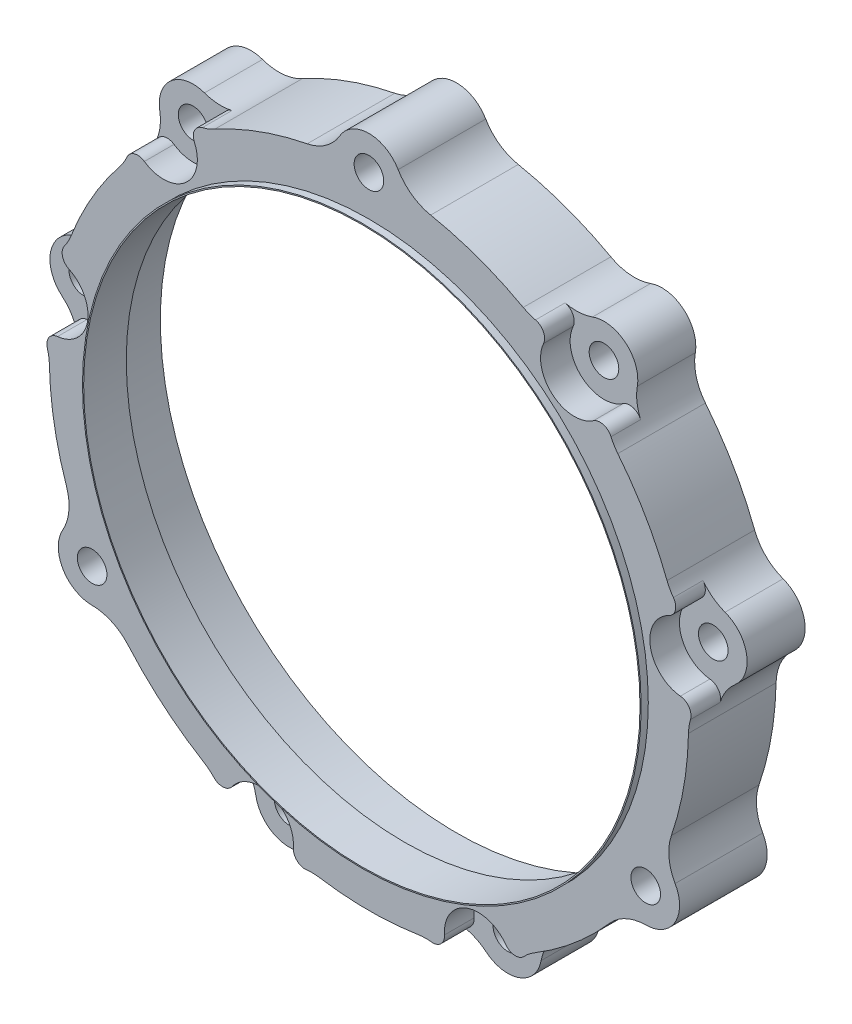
ISO-10303-21;
HEADER;
FILE_DESCRIPTION(('STEP AP214'),'2;1');
FILE_NAME('part.step','',(''),(''),'','','');
FILE_SCHEMA(('AUTOMOTIVE_DESIGN { 1 0 10303 214 1 1 1 1 }'));
ENDSEC;
DATA;
#1=APPLICATION_CONTEXT('core data for automotive mechanical design processes');
#2=APPLICATION_PROTOCOL_DEFINITION('international standard','automotive_design',2000,#1);
#3=PRODUCT_CONTEXT('',#1,'mechanical');
#4=PRODUCT('Part','Part','',(#3));
#5=PRODUCT_RELATED_PRODUCT_CATEGORY('part','',(#4));
#6=PRODUCT_DEFINITION_FORMATION('','',#4);
#7=PRODUCT_DEFINITION_CONTEXT('part definition',#1,'design');
#8=PRODUCT_DEFINITION('design','',#6,#7);
#9=PRODUCT_DEFINITION_SHAPE('','',#8);
#10=(LENGTH_UNIT() NAMED_UNIT(*) SI_UNIT(.MILLI.,.METRE.));
#11=(NAMED_UNIT(*) PLANE_ANGLE_UNIT() SI_UNIT($,.RADIAN.));
#12=(NAMED_UNIT(*) SI_UNIT($,.STERADIAN.) SOLID_ANGLE_UNIT());
#13=UNCERTAINTY_MEASURE_WITH_UNIT(LENGTH_MEASURE(1.E-05),#10,'distance_accuracy_value','');
#14=(GEOMETRIC_REPRESENTATION_CONTEXT(3) GLOBAL_UNCERTAINTY_ASSIGNED_CONTEXT((#13)) GLOBAL_UNIT_ASSIGNED_CONTEXT((#10,
#11,#12)) REPRESENTATION_CONTEXT('',''));
#15=CARTESIAN_POINT('',(0.,0.,0.));
#16=DIRECTION('',(0.,0.,1.));
#17=DIRECTION('',(1.,0.,0.));
#18=AXIS2_PLACEMENT_3D('',#15,#16,#17);
#19=CARTESIAN_POINT('',(0.,0.,3.));
#20=DIRECTION('',(0.,0.,1.));
#21=DIRECTION('',(1.,0.,0.));
#22=AXIS2_PLACEMENT_3D('',#19,#20,#21);
#23=PLANE('',#22);
#24=CARTESIAN_POINT('',(-23.3826859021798,-13.5,3.));
#25=DIRECTION('',(0.,0.,1.));
#26=DIRECTION('',(1.,0.,0.));
#27=AXIS2_PLACEMENT_3D('',#24,#25,#26);
#28=CIRCLE('',#27,1.25);
#29=CARTESIAN_POINT('',(-22.1326859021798,-13.5,3.));
#30=VERTEX_POINT('',#29);
#31=EDGE_CURVE('E431',#30,#30,#28,.T.);
#32=ORIENTED_EDGE('',*,*,#31,.F.);
#33=EDGE_LOOP('',(#32));
#34=FACE_BOUND('',#33,.T.);
#35=CARTESIAN_POINT('',(23.3826859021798,-13.5,3.));
#36=DIRECTION('',(0.,0.,1.));
#37=DIRECTION('',(1.,0.,0.));
#38=AXIS2_PLACEMENT_3D('',#35,#36,#37);
#39=CIRCLE('',#38,1.25);
#40=CARTESIAN_POINT('',(24.6326859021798,-13.5,3.));
#41=VERTEX_POINT('',#40);
#42=EDGE_CURVE('E679',#41,#41,#39,.T.);
#43=ORIENTED_EDGE('',*,*,#42,.F.);
#44=EDGE_LOOP('',(#43));
#45=FACE_BOUND('',#44,.T.);
#46=CARTESIAN_POINT('',(0.,27.,3.));
#47=DIRECTION('',(0.,0.,1.));
#48=DIRECTION('',(1.,0.,0.));
#49=AXIS2_PLACEMENT_3D('',#46,#47,#48);
#50=CIRCLE('',#49,1.25);
#51=CARTESIAN_POINT('',(1.25,27.,3.));
#52=VERTEX_POINT('',#51);
#53=EDGE_CURVE('E766',#52,#52,#50,.T.);
#54=ORIENTED_EDGE('',*,*,#53,.F.);
#55=EDGE_LOOP('',(#54));
#56=FACE_BOUND('',#55,.T.);
#57=CARTESIAN_POINT('',(-26.5898093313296,4.68850079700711,3.));
#58=DIRECTION('',(0.,0.,1.));
#59=DIRECTION('',(1.,0.,0.));
#60=AXIS2_PLACEMENT_3D('',#57,#58,#59);
#61=CIRCLE('',#60,2.85882618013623);
#62=CARTESIAN_POINT('',(-26.307480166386,1.84364976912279,3.));
#63=VERTEX_POINT('',#62);
#64=CARTESIAN_POINT('',(-25.3515103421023,7.26522405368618,3.));
#65=VERTEX_POINT('',#64);
#66=EDGE_CURVE('E584',#63,#65,#61,.T.);
#67=ORIENTED_EDGE('',*,*,#66,.F.);
#68=CARTESIAN_POINT('',(-26.2087231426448,0.848538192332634,3.));
#69=DIRECTION('',(0.,0.,1.));
#70=DIRECTION('',(1.,0.,0.));
#71=AXIS2_PLACEMENT_3D('',#68,#69,#70);
#72=CIRCLE('',#71,1.);
#73=CARTESIAN_POINT('',(-27.1666004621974,0.561360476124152,3.));
#74=VERTEX_POINT('',#73);
#75=EDGE_CURVE('E816',#63,#74,#72,.T.);
#76=ORIENTED_EDGE('',*,*,#75,.T.);
#77=CARTESIAN_POINT('',(-31.0938974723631,-0.616068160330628,3.));
#78=DIRECTION('',(0.,0.,1.));
#79=DIRECTION('',(1.,0.,0.));
#80=AXIS2_PLACEMENT_3D('',#77,#78,#79);
#81=CIRCLE('',#80,4.1);
#82=CARTESIAN_POINT('',(-26.9947019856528,-0.534850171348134,3.));
#83=VERTEX_POINT('',#82);
#84=EDGE_CURVE('E625',#83,#74,#81,.T.);
#85=ORIENTED_EDGE('',*,*,#84,.F.);
#86=CARTESIAN_POINT('',(0.,0.,3.));
#87=DIRECTION('',(0.,0.,1.));
#88=DIRECTION('',(1.,0.,0.));
#89=AXIS2_PLACEMENT_3D('',#86,#87,#88);
#90=CIRCLE('',#89,27.);
#91=CARTESIAN_POINT('',(-25.5496517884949,-8.7301370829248,3.));
#92=VERTEX_POINT('',#91);
#93=EDGE_CURVE('E427',#83,#92,#90,.T.);
#94=ORIENTED_EDGE('',*,*,#93,.T.);
#95=CARTESIAN_POINT('',(-29.4294137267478,-10.0558245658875,3.));
#96=DIRECTION('',(0.,0.,1.));
#97=DIRECTION('',(1.,0.,0.));
#98=AXIS2_PLACEMENT_3D('',#95,#96,#97);
#99=CIRCLE('',#98,4.1);
#100=CARTESIAN_POINT('',(-25.8668036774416,-12.0850632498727,3.));
#101=VERTEX_POINT('',#100);
#102=EDGE_CURVE('E636',#101,#92,#99,.T.);
#103=ORIENTED_EDGE('',*,*,#102,.F.);
#104=CARTESIAN_POINT('',(-23.3826859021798,-13.5,3.));
#105=DIRECTION('',(0.,0.,1.));
#106=DIRECTION('',(1.,0.,0.));
#107=AXIS2_PLACEMENT_3D('',#104,#105,#106);
#108=CIRCLE('',#107,2.85882618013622);
#109=CARTESIAN_POINT('',(-23.3993736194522,-16.3587774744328,3.));
#110=VERTEX_POINT('',#109);
#111=EDGE_CURVE('E639',#110,#101,#108,.F.);
#112=ORIENTED_EDGE('',*,*,#111,.F.);
#113=CARTESIAN_POINT('',(-23.4233063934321,-20.4587076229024,3.));
#114=DIRECTION('',(0.,0.,1.));
#115=DIRECTION('',(1.,0.,0.));
#116=AXIS2_PLACEMENT_3D('',#113,#114,#115);
#117=CIRCLE('',#116,4.1);
#118=CARTESIAN_POINT('',(-20.3353463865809,-17.7615789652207,3.));
#119=VERTEX_POINT('',#118);
#120=EDGE_CURVE('E641',#119,#110,#117,.T.);
#121=ORIENTED_EDGE('',*,*,#120,.F.);
#122=CARTESIAN_POINT('',(-13.9605448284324,-23.1106726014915,3.));
#123=VERTEX_POINT('',#122);
#124=EDGE_CURVE('E958',#119,#123,#90,.T.);
#125=ORIENTED_EDGE('',*,*,#124,.T.);
#126=CARTESIAN_POINT('',(-16.0804794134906,-26.6200710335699,3.));
#127=DIRECTION('',(0.,0.,1.));
#128=DIRECTION('',(1.,0.,0.));
#129=AXIS2_PLACEMENT_3D('',#126,#127,#128);
#130=CIRCLE('',#129,4.1);
#131=CARTESIAN_POINT('',(-13.0971477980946,-23.8076463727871,3.));
#132=VERTEX_POINT('',#131);
#133=EDGE_CURVE('E647',#132,#123,#130,.T.);
#134=ORIENTED_EDGE('',*,*,#133,.F.);
#135=CARTESIAN_POINT('',(-12.369505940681,-23.1216891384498,3.));
#136=DIRECTION('',(0.,0.,1.));
#137=DIRECTION('',(1.,0.,0.));
#138=AXIS2_PLACEMENT_3D('',#135,#136,#137);
#139=CIRCLE('',#138,1.);
#140=CARTESIAN_POINT('',(-11.5570925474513,-23.7047710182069,3.));
#141=VERTEX_POINT('',#140);
#142=EDGE_CURVE('E794',#132,#141,#139,.T.);
#143=ORIENTED_EDGE('',*,*,#142,.T.);
#144=CARTESIAN_POINT('',(-9.23454386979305,-25.3717007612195,3.));
#145=DIRECTION('',(0.,0.,1.));
#146=DIRECTION('',(1.,0.,0.));
#147=AXIS2_PLACEMENT_3D('',#144,#145,#146);
#148=CIRCLE('',#147,2.85882618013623);
#149=CARTESIAN_POINT('',(-6.38388657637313,-25.5876640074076,3.));
#150=VERTEX_POINT('',#149);
#151=EDGE_CURVE('E591',#150,#141,#148,.T.);
#152=ORIENTED_EDGE('',*,*,#151,.F.);
#153=CARTESIAN_POINT('',(-5.38674400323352,-25.6632066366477,3.));
#154=DIRECTION('',(0.,0.,1.));
#155=DIRECTION('',(1.,0.,0.));
#156=AXIS2_PLACEMENT_3D('',#153,#154,#155);
#157=CIRCLE('',#156,1.);
#158=CARTESIAN_POINT('',(-5.27026281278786,-26.6563995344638,3.));
#159=VERTEX_POINT('',#158);
#160=EDGE_CURVE('E796',#150,#159,#157,.T.);
#161=ORIENTED_EDGE('',*,*,#160,.T.);
#162=CARTESIAN_POINT('',(-4.79268993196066,-30.7284904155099,3.));
#163=DIRECTION('',(0.,0.,1.));
#164=DIRECTION('',(1.,0.,0.));
#165=AXIS2_PLACEMENT_3D('',#162,#163,#164);
#166=CIRCLE('',#165,4.1);
#167=CARTESIAN_POINT('',(-4.16085621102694,-26.6774675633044,3.));
#168=VERTEX_POINT('',#167);
#169=EDGE_CURVE('E656',#168,#159,#166,.T.);
#170=ORIENTED_EDGE('',*,*,#169,.F.);
#171=CARTESIAN_POINT('',(4.16085621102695,-26.6774675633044,3.));
#172=VERTEX_POINT('',#171);
#173=EDGE_CURVE('E949',#168,#172,#90,.T.);
#174=ORIENTED_EDGE('',*,*,#173,.T.);
#175=CARTESIAN_POINT('',(4.79268993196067,-30.7284904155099,3.));
#176=DIRECTION('',(0.,0.,1.));
#177=DIRECTION('',(1.,0.,0.));
#178=AXIS2_PLACEMENT_3D('',#175,#176,#177);
#179=CIRCLE('',#178,4.1);
#180=CARTESIAN_POINT('',(5.27026281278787,-26.6563995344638,3.));
#181=VERTEX_POINT('',#180);
#182=EDGE_CURVE('E663',#181,#172,#179,.T.);
#183=ORIENTED_EDGE('',*,*,#182,.F.);
#184=CARTESIAN_POINT('',(5.38674400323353,-25.6632066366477,3.));
#185=DIRECTION('',(0.,0.,1.));
#186=DIRECTION('',(1.,0.,0.));
#187=AXIS2_PLACEMENT_3D('',#184,#185,#186);
#188=CIRCLE('',#187,1.);
#189=CARTESIAN_POINT('',(6.38388657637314,-25.5876640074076,3.));
#190=VERTEX_POINT('',#189);
#191=EDGE_CURVE('E800',#181,#190,#188,.T.);
#192=ORIENTED_EDGE('',*,*,#191,.T.);
#193=CARTESIAN_POINT('',(9.23454386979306,-25.3717007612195,3.));
#194=DIRECTION('',(0.,0.,1.));
#195=DIRECTION('',(1.,0.,0.));
#196=AXIS2_PLACEMENT_3D('',#193,#194,#195);
#197=CIRCLE('',#196,2.85882618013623);
#198=CARTESIAN_POINT('',(11.5570925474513,-23.7047710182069,3.));
#199=VERTEX_POINT('',#198);
#200=EDGE_CURVE('E563',#199,#190,#197,.T.);
#201=ORIENTED_EDGE('',*,*,#200,.F.);
#202=CARTESIAN_POINT('',(12.369505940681,-23.1216891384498,3.));
#203=DIRECTION('',(0.,0.,1.));
#204=DIRECTION('',(1.,0.,0.));
#205=AXIS2_PLACEMENT_3D('',#202,#203,#204);
#206=CIRCLE('',#205,1.);
#207=CARTESIAN_POINT('',(13.0971477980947,-23.8076463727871,3.));
#208=VERTEX_POINT('',#207);
#209=EDGE_CURVE('E798',#199,#208,#206,.T.);
#210=ORIENTED_EDGE('',*,*,#209,.T.);
#211=CARTESIAN_POINT('',(16.0804794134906,-26.6200710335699,3.));
#212=DIRECTION('',(0.,0.,1.));
#213=DIRECTION('',(1.,0.,0.));
#214=AXIS2_PLACEMENT_3D('',#211,#212,#213);
#215=CIRCLE('',#214,4.1);
#216=CARTESIAN_POINT('',(13.9605448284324,-23.1106726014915,3.));
#217=VERTEX_POINT('',#216);
#218=EDGE_CURVE('E672',#217,#208,#215,.T.);
#219=ORIENTED_EDGE('',*,*,#218,.F.);
#220=CARTESIAN_POINT('',(20.3353463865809,-17.7615789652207,3.));
#221=VERTEX_POINT('',#220);
#222=EDGE_CURVE('E959',#217,#221,#90,.T.);
#223=ORIENTED_EDGE('',*,*,#222,.T.);
#224=CARTESIAN_POINT('',(23.4233063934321,-20.4587076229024,3.));
#225=DIRECTION('',(0.,0.,1.));
#226=DIRECTION('',(1.,0.,0.));
#227=AXIS2_PLACEMENT_3D('',#224,#225,#226);
#228=CIRCLE('',#227,4.1);
#229=CARTESIAN_POINT('',(23.3993736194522,-16.3587774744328,3.));
#230=VERTEX_POINT('',#229);
#231=EDGE_CURVE('E689',#230,#221,#228,.T.);
#232=ORIENTED_EDGE('',*,*,#231,.F.);
#233=CARTESIAN_POINT('',(23.3826859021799,-13.5,3.));
#234=DIRECTION('',(0.,0.,1.));
#235=DIRECTION('',(1.,0.,0.));
#236=AXIS2_PLACEMENT_3D('',#233,#234,#235);
#237=CIRCLE('',#236,2.85882618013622);
#238=CARTESIAN_POINT('',(25.8668036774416,-12.0850632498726,3.));
#239=VERTEX_POINT('',#238);
#240=EDGE_CURVE('E692',#239,#230,#237,.F.);
#241=ORIENTED_EDGE('',*,*,#240,.F.);
#242=CARTESIAN_POINT('',(29.4294137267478,-10.0558245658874,3.));
#243=DIRECTION('',(0.,0.,1.));
#244=DIRECTION('',(1.,0.,0.));
#245=AXIS2_PLACEMENT_3D('',#242,#243,#244);
#246=CIRCLE('',#245,4.1);
#247=CARTESIAN_POINT('',(25.5496517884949,-8.73013708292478,3.));
#248=VERTEX_POINT('',#247);
#249=EDGE_CURVE('E694',#248,#239,#246,.T.);
#250=ORIENTED_EDGE('',*,*,#249,.F.);
#251=CARTESIAN_POINT('',(26.9947019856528,-0.534850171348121,3.));
#252=VERTEX_POINT('',#251);
#253=EDGE_CURVE('E961',#248,#252,#90,.T.);
#254=ORIENTED_EDGE('',*,*,#253,.T.);
#255=CARTESIAN_POINT('',(31.0938974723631,-0.616068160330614,3.));
#256=DIRECTION('',(0.,0.,1.));
#257=DIRECTION('',(1.,0.,0.));
#258=AXIS2_PLACEMENT_3D('',#255,#256,#257);
#259=CIRCLE('',#258,4.1);
#260=CARTESIAN_POINT('',(27.1666004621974,0.561360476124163,3.));
#261=VERTEX_POINT('',#260);
#262=EDGE_CURVE('E700',#261,#252,#259,.T.);
#263=ORIENTED_EDGE('',*,*,#262,.F.);
#264=CARTESIAN_POINT('',(26.2087231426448,0.848538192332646,3.));
#265=DIRECTION('',(0.,0.,1.));
#266=DIRECTION('',(1.,0.,0.));
#267=AXIS2_PLACEMENT_3D('',#264,#265,#266);
#268=CIRCLE('',#267,1.);
#269=CARTESIAN_POINT('',(26.307480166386,1.8436497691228,3.));
#270=VERTEX_POINT('',#269);
#271=EDGE_CURVE('E804',#261,#270,#268,.T.);
#272=ORIENTED_EDGE('',*,*,#271,.T.);
#273=CARTESIAN_POINT('',(26.5898093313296,4.68850079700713,3.));
#274=DIRECTION('',(0.,0.,1.));
#275=DIRECTION('',(1.,0.,0.));
#276=AXIS2_PLACEMENT_3D('',#273,#274,#275);
#277=CIRCLE('',#276,2.85882618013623);
#278=CARTESIAN_POINT('',(25.3515103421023,7.26522405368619,3.));
#279=VERTEX_POINT('',#278);
#280=EDGE_CURVE('E577',#279,#270,#277,.T.);
#281=ORIENTED_EDGE('',*,*,#280,.F.);
#282=CARTESIAN_POINT('',(24.9183608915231,8.16654616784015,3.));
#283=DIRECTION('',(0.,0.,1.));
#284=DIRECTION('',(1.,0.,0.));
#285=AXIS2_PLACEMENT_3D('',#282,#283,#284);
#286=CIRCLE('',#285,1.);
#287=CARTESIAN_POINT('',(25.7202505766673,8.7640182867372,3.));
#288=VERTEX_POINT('',#287);
#289=EDGE_CURVE('E802',#279,#288,#286,.T.);
#290=ORIENTED_EDGE('',*,*,#289,.T.);
#291=CARTESIAN_POINT('',(29.0079982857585,11.2136539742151,3.));
#292=DIRECTION('',(0.,0.,1.));
#293=DIRECTION('',(1.,0.,0.));
#294=AXIS2_PLACEMENT_3D('',#291,#292,#293);
#295=CIRCLE('',#294,4.1);
#296=CARTESIAN_POINT('',(25.1837927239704,9.73532660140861,3.));
#297=VERTEX_POINT('',#296);
#298=EDGE_CURVE('E710',#297,#288,#295,.T.);
#299=ORIENTED_EDGE('',*,*,#298,.F.);
#300=CARTESIAN_POINT('',(21.0229365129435,16.9421409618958,3.));
#301=VERTEX_POINT('',#300);
#302=EDGE_CURVE('E965',#297,#301,#90,.T.);
#303=ORIENTED_EDGE('',*,*,#302,.T.);
#304=CARTESIAN_POINT('',(24.2153083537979,19.5148364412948,3.));
#305=DIRECTION('',(0.,0.,1.));
#306=DIRECTION('',(1.,0.,0.));
#307=AXIS2_PLACEMENT_3D('',#304,#305,#306);
#308=CIRCLE('',#307,4.1);
#309=CARTESIAN_POINT('',(20.4499877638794,17.8923812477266,3.));
#310=VERTEX_POINT('',#309);
#311=EDGE_CURVE('E717',#310,#301,#308,.T.);
#312=ORIENTED_EDGE('',*,*,#311,.F.);
#313=CARTESIAN_POINT('',(19.5316168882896,17.4966604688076,3.));
#314=DIRECTION('',(0.,0.,1.));
#315=DIRECTION('',(1.,0.,0.));
#316=AXIS2_PLACEMENT_3D('',#313,#314,#315);
#317=CIRCLE('',#316,1.);
#318=CARTESIAN_POINT('',(18.9676237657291,18.3224399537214,3.));
#319=VERTEX_POINT('',#318);
#320=EDGE_CURVE('E808',#310,#319,#317,.T.);
#321=ORIENTED_EDGE('',*,*,#320,.T.);
#322=CARTESIAN_POINT('',(17.3552654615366,20.6831999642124,3.));
#323=DIRECTION('',(0.,0.,1.));
#324=DIRECTION('',(1.,0.,0.));
#325=AXIS2_PLACEMENT_3D('',#322,#323,#324);
#326=CIRCLE('',#325,2.85882618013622);
#327=CARTESIAN_POINT('',(14.7503876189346,21.8611212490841,3.));
#328=VERTEX_POINT('',#327);
#329=EDGE_CURVE('E569',#328,#319,#326,.T.);
#330=ORIENTED_EDGE('',*,*,#329,.F.);
#331=CARTESIAN_POINT('',(13.8392172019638,22.2731509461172,3.));
#332=DIRECTION('',(0.,0.,1.));
#333=DIRECTION('',(1.,0.,0.));
#334=AXIS2_PLACEMENT_3D('',#331,#332,#333);
#335=CIRCLE('',#334,1.);
#336=CARTESIAN_POINT('',(14.0694526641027,23.2462858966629,3.));
#337=VERTEX_POINT('',#336);
#338=EDGE_CURVE('E806',#328,#337,#335,.T.);
#339=ORIENTED_EDGE('',*,*,#338,.T.);
#340=CARTESIAN_POINT('',(15.0134180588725,27.2361391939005,3.));
#341=DIRECTION('',(0.,0.,1.));
#342=DIRECTION('',(1.,0.,0.));
#343=AXIS2_PLACEMENT_3D('',#340,#341,#342);
#344=CIRCLE('',#343,4.09999999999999);
#345=CARTESIAN_POINT('',(13.0341571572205,23.6455227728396,3.));
#346=VERTEX_POINT('',#345);
#347=EDGE_CURVE('E727',#346,#337,#344,.T.);
#348=ORIENTED_EDGE('',*,*,#347,.F.);
#349=CARTESIAN_POINT('',(5.21430540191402,26.4917160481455,3.));
#350=VERTEX_POINT('',#349);
#351=EDGE_CURVE('E784',#346,#350,#90,.T.);
#352=ORIENTED_EDGE('',*,*,#351,.T.);
#353=CARTESIAN_POINT('',(6.00610733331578,30.5145321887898,3.));
#354=DIRECTION('',(0.,0.,1.));
#355=DIRECTION('',(1.,0.,0.));
#356=AXIS2_PLACEMENT_3D('',#353,#354,#355);
#357=CIRCLE('',#356,4.1);
#358=CARTESIAN_POINT('',(2.46743005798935,28.4438407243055,3.));
#359=VERTEX_POINT('',#358);
#360=EDGE_CURVE('E751',#359,#350,#357,.T.);
#361=ORIENTED_EDGE('',*,*,#360,.F.);
#362=CARTESIAN_POINT('',(0.,27.,3.));
#363=DIRECTION('',(0.,0.,1.));
#364=DIRECTION('',(1.,0.,0.));
#365=AXIS2_PLACEMENT_3D('',#362,#363,#364);
#366=CIRCLE('',#365,2.85882618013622);
#367=CARTESIAN_POINT('',(-2.46743005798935,28.4438407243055,3.));
#368=VERTEX_POINT('',#367);
#369=EDGE_CURVE('E762',#368,#359,#366,.F.);
#370=ORIENTED_EDGE('',*,*,#369,.F.);
#371=CARTESIAN_POINT('',(-6.00610733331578,30.5145321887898,3.));
#372=DIRECTION('',(0.,0.,1.));
#373=DIRECTION('',(1.,0.,0.));
#374=AXIS2_PLACEMENT_3D('',#371,#372,#373);
#375=CIRCLE('',#374,4.1);
#376=CARTESIAN_POINT('',(-5.21430540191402,26.4917160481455,3.));
#377=VERTEX_POINT('',#376);
#378=EDGE_CURVE('E764',#377,#368,#375,.T.);
#379=ORIENTED_EDGE('',*,*,#378,.F.);
#380=CARTESIAN_POINT('',(-13.0341571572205,23.6455227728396,3.));
#381=VERTEX_POINT('',#380);
#382=EDGE_CURVE('E785',#377,#381,#90,.T.);
#383=ORIENTED_EDGE('',*,*,#382,.T.);
#384=CARTESIAN_POINT('',(-15.0134180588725,27.2361391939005,3.));
#385=DIRECTION('',(0.,0.,1.));
#386=DIRECTION('',(1.,0.,0.));
#387=AXIS2_PLACEMENT_3D('',#384,#385,#386);
#388=CIRCLE('',#387,4.10000000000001);
#389=CARTESIAN_POINT('',(-14.0694526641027,23.2462858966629,3.));
#390=VERTEX_POINT('',#389);
#391=EDGE_CURVE('E734',#390,#381,#388,.T.);
#392=ORIENTED_EDGE('',*,*,#391,.F.);
#393=CARTESIAN_POINT('',(-13.8392172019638,22.2731509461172,3.));
#394=DIRECTION('',(0.,0.,1.));
#395=DIRECTION('',(1.,0.,0.));
#396=AXIS2_PLACEMENT_3D('',#393,#394,#395);
#397=CIRCLE('',#396,1.);
#398=CARTESIAN_POINT('',(-14.7503876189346,21.8611212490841,3.));
#399=VERTEX_POINT('',#398);
#400=EDGE_CURVE('E812',#390,#399,#397,.T.);
#401=ORIENTED_EDGE('',*,*,#400,.T.);
#402=CARTESIAN_POINT('',(-17.3552654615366,20.6831999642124,3.));
#403=DIRECTION('',(0.,0.,1.));
#404=DIRECTION('',(1.,0.,0.));
#405=AXIS2_PLACEMENT_3D('',#402,#403,#404);
#406=CIRCLE('',#405,2.85882618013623);
#407=CARTESIAN_POINT('',(-18.9676237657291,18.3224399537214,3.));
#408=VERTEX_POINT('',#407);
#409=EDGE_CURVE('E572',#408,#399,#406,.T.);
#410=ORIENTED_EDGE('',*,*,#409,.F.);
#411=CARTESIAN_POINT('',(-19.5316168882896,17.4966604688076,3.));
#412=DIRECTION('',(0.,0.,1.));
#413=DIRECTION('',(1.,0.,0.));
#414=AXIS2_PLACEMENT_3D('',#411,#412,#413);
#415=CIRCLE('',#414,1.);
#416=CARTESIAN_POINT('',(-20.4499877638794,17.8923812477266,3.));
#417=VERTEX_POINT('',#416);
#418=EDGE_CURVE('E810',#408,#417,#415,.T.);
#419=ORIENTED_EDGE('',*,*,#418,.T.);
#420=CARTESIAN_POINT('',(-24.2153083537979,19.5148364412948,3.));
#421=DIRECTION('',(0.,0.,1.));
#422=DIRECTION('',(1.,0.,0.));
#423=AXIS2_PLACEMENT_3D('',#420,#421,#422);
#424=CIRCLE('',#423,4.09999999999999);
#425=CARTESIAN_POINT('',(-21.0229365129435,16.9421409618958,3.));
#426=VERTEX_POINT('',#425);
#427=EDGE_CURVE('E744',#426,#417,#424,.T.);
#428=ORIENTED_EDGE('',*,*,#427,.F.);
#429=CARTESIAN_POINT('',(-25.1837927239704,9.73532660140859,3.));
#430=VERTEX_POINT('',#429);
#431=EDGE_CURVE('E789',#426,#430,#90,.T.);
#432=ORIENTED_EDGE('',*,*,#431,.T.);
#433=CARTESIAN_POINT('',(-29.0079982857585,11.2136539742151,3.));
#434=DIRECTION('',(0.,0.,1.));
#435=DIRECTION('',(1.,0.,0.));
#436=AXIS2_PLACEMENT_3D('',#433,#434,#435);
#437=CIRCLE('',#436,4.1);
#438=CARTESIAN_POINT('',(-25.7202505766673,8.76401828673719,3.));
#439=VERTEX_POINT('',#438);
#440=EDGE_CURVE('E623',#439,#430,#437,.T.);
#441=ORIENTED_EDGE('',*,*,#440,.F.);
#442=CARTESIAN_POINT('',(-24.9183608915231,8.16654616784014,3.));
#443=DIRECTION('',(0.,0.,1.));
#444=DIRECTION('',(1.,0.,0.));
#445=AXIS2_PLACEMENT_3D('',#442,#443,#444);
#446=CIRCLE('',#445,1.);
#447=EDGE_CURVE('E814',#439,#65,#446,.T.);
#448=ORIENTED_EDGE('',*,*,#447,.T.);
#449=EDGE_LOOP('',(#67,#76,#85,#94,#103,#112,#121,#125,#134,#143,#152,#161,#170,#174,#183,#192,
#201,#210,#219,#223,#232,#241,#250,#254,#263,#272,#281,#290,#299,#303,#312,#321,#330,#339,#348,
#352,#361,#370,#379,#383,#392,#401,#410,#419,#428,#432,#441,#448));
#450=FACE_BOUND('',#449,.T.);
#451=CARTESIAN_POINT('',(0.,0.,3.));
#452=DIRECTION('',(0.,0.,1.));
#453=DIRECTION('',(1.,0.,0.));
#454=AXIS2_PLACEMENT_3D('',#451,#452,#453);
#455=CIRCLE('',#454,23.6);
#456=CARTESIAN_POINT('',(23.6,0.,3.));
#457=VERTEX_POINT('',#456);
#458=EDGE_CURVE('E556',#457,#457,#455,.T.);
#459=ORIENTED_EDGE('',*,*,#458,.F.);
#460=EDGE_LOOP('',(#459));
#461=FACE_BOUND('',#460,.T.);
#462=ADVANCED_FACE('F43',(#34,#45,#56,#450,#461),#23,.T.);
#463=CARTESIAN_POINT('',(-17.3552654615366,20.6831999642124,0.));
#464=DIRECTION('',(0.,0.,1.));
#465=DIRECTION('',(1.,0.,0.));
#466=AXIS2_PLACEMENT_3D('',#463,#464,#465);
#467=CYLINDRICAL_SURFACE('',#466,1.25);
#468=CARTESIAN_POINT('',(-17.3552654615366,20.6831999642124,0.5));
#469=DIRECTION('',(0.,0.,1.));
#470=DIRECTION('',(1.,0.,0.));
#471=AXIS2_PLACEMENT_3D('',#468,#469,#470);
#472=CIRCLE('',#471,1.25);
#473=CARTESIAN_POINT('',(-16.1052654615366,20.6831999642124,0.5));
#474=VERTEX_POINT('',#473);
#475=EDGE_CURVE('E617',#474,#474,#472,.F.);
#476=ORIENTED_EDGE('',*,*,#475,.F.);
#477=EDGE_LOOP('',(#476));
#478=FACE_BOUND('',#477,.T.);
#479=CARTESIAN_POINT('',(-17.3552654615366,20.6831999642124,-4.4));
#480=DIRECTION('',(0.,0.,-1.));
#481=DIRECTION('',(-1.,0.,0.));
#482=AXIS2_PLACEMENT_3D('',#479,#480,#481);
#483=CIRCLE('',#482,1.25000000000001);
#484=CARTESIAN_POINT('',(-18.6052654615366,20.6831999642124,-4.4));
#485=VERTEX_POINT('',#484);
#486=EDGE_CURVE('E2165',#485,#485,#483,.T.);
#487=ORIENTED_EDGE('',*,*,#486,.T.);
#488=EDGE_LOOP('',(#487));
#489=FACE_BOUND('',#488,.T.);
#490=ADVANCED_FACE('F1010',(#478,#489),#467,.F.);
#491=CARTESIAN_POINT('',(-17.3552654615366,20.6831999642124,0.));
#492=DIRECTION('',(0.,0.,1.));
#493=DIRECTION('',(1.,0.,0.));
#494=AXIS2_PLACEMENT_3D('',#491,#492,#493);
#495=CYLINDRICAL_SURFACE('',#494,2.85882618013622);
#496=CARTESIAN_POINT('',(-17.3552654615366,20.6831999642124,0.5));
#497=DIRECTION('',(0.,0.,1.));
#498=DIRECTION('',(1.,0.,0.));
#499=AXIS2_PLACEMENT_3D('',#496,#497,#498);
#500=CIRCLE('',#499,2.85882618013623);
#501=CARTESIAN_POINT('',(-16.3931873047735,23.3752795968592,0.5));
#502=VERTEX_POINT('',#501);
#503=CARTESIAN_POINT('',(-20.1735094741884,20.2032126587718,0.5));
#504=VERTEX_POINT('',#503);
#505=EDGE_CURVE('E596',#502,#504,#500,.T.);
#506=ORIENTED_EDGE('',*,*,#505,.F.);
#507=DIRECTION('',(0.,0.,1.));
#508=VECTOR('',#507,1.);
#509=CARTESIAN_POINT('',(-16.3931873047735,23.3752795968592,0.));
#510=LINE('',#509,#508);
#511=CARTESIAN_POINT('',(-16.3931873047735,23.3752795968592,-4.4));
#512=VERTEX_POINT('',#511);
#513=EDGE_CURVE('E755',#512,#502,#510,.T.);
#514=ORIENTED_EDGE('',*,*,#513,.F.);
#515=CARTESIAN_POINT('',(-17.3552654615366,20.6831999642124,-4.4));
#516=DIRECTION('',(0.,0.,-1.));
#517=DIRECTION('',(-1.,0.,0.));
#518=AXIS2_PLACEMENT_3D('',#515,#516,#517);
#519=CIRCLE('',#518,2.85882618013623);
#520=CARTESIAN_POINT('',(-20.1735094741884,20.2032126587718,-4.4));
#521=VERTEX_POINT('',#520);
#522=EDGE_CURVE('E466',#521,#512,#519,.T.);
#523=ORIENTED_EDGE('',*,*,#522,.F.);
#524=DIRECTION('',(0.,0.,1.));
#525=VECTOR('',#524,1.);
#526=CARTESIAN_POINT('',(-20.1735094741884,20.2032126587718,0.));
#527=LINE('',#526,#525);
#528=EDGE_CURVE('E752',#521,#504,#527,.T.);
#529=ORIENTED_EDGE('',*,*,#528,.T.);
#530=EDGE_LOOP('',(#506,#514,#523,#529));
#531=FACE_BOUND('',#530,.T.);
#532=ADVANCED_FACE('F1017',(#531),#495,.T.);
#533=CARTESIAN_POINT('',(17.3552654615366,20.6831999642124,0.));
#534=DIRECTION('',(0.,0.,1.));
#535=DIRECTION('',(1.,0.,0.));
#536=AXIS2_PLACEMENT_3D('',#533,#534,#535);
#537=CYLINDRICAL_SURFACE('',#536,1.25);
#538=CARTESIAN_POINT('',(17.3552654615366,20.6831999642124,0.5));
#539=DIRECTION('',(0.,0.,1.));
#540=DIRECTION('',(1.,0.,0.));
#541=AXIS2_PLACEMENT_3D('',#538,#539,#540);
#542=CIRCLE('',#541,1.25);
#543=CARTESIAN_POINT('',(18.6052654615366,20.6831999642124,0.5));
#544=VERTEX_POINT('',#543);
#545=EDGE_CURVE('E614',#544,#544,#542,.F.);
#546=ORIENTED_EDGE('',*,*,#545,.F.);
#547=EDGE_LOOP('',(#546));
#548=FACE_BOUND('',#547,.T.);
#549=CARTESIAN_POINT('',(17.3552654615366,20.6831999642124,-4.4));
#550=DIRECTION('',(0.,0.,-1.));
#551=DIRECTION('',(-1.,0.,0.));
#552=AXIS2_PLACEMENT_3D('',#549,#550,#551);
#553=CIRCLE('',#552,1.25);
#554=CARTESIAN_POINT('',(16.1052654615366,20.6831999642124,-4.4));
#555=VERTEX_POINT('',#554);
#556=EDGE_CURVE('E2192',#555,#555,#553,.T.);
#557=ORIENTED_EDGE('',*,*,#556,.T.);
#558=EDGE_LOOP('',(#557));
#559=FACE_BOUND('',#558,.T.);
#560=ADVANCED_FACE('F1284',(#548,#559),#537,.F.);
#561=CARTESIAN_POINT('',(17.3552654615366,20.6831999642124,0.));
#562=DIRECTION('',(0.,0.,1.));
#563=DIRECTION('',(1.,0.,0.));
#564=AXIS2_PLACEMENT_3D('',#561,#562,#563);
#565=CYLINDRICAL_SURFACE('',#564,2.85882618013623);
#566=CARTESIAN_POINT('',(17.3552654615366,20.6831999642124,0.5));
#567=DIRECTION('',(0.,0.,1.));
#568=DIRECTION('',(1.,0.,0.));
#569=AXIS2_PLACEMENT_3D('',#566,#567,#568);
#570=CIRCLE('',#569,2.85882618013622);
#571=CARTESIAN_POINT('',(20.1735094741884,20.2032126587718,0.5));
#572=VERTEX_POINT('',#571);
#573=CARTESIAN_POINT('',(16.3931873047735,23.3752795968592,0.5));
#574=VERTEX_POINT('',#573);
#575=EDGE_CURVE('E576',#572,#574,#570,.T.);
#576=ORIENTED_EDGE('',*,*,#575,.F.);
#577=DIRECTION('',(0.,0.,1.));
#578=VECTOR('',#577,1.);
#579=CARTESIAN_POINT('',(20.1735094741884,20.2032126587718,0.));
#580=LINE('',#579,#578);
#581=CARTESIAN_POINT('',(20.1735094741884,20.2032126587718,-4.4));
#582=VERTEX_POINT('',#581);
#583=EDGE_CURVE('E738',#582,#572,#580,.T.);
#584=ORIENTED_EDGE('',*,*,#583,.F.);
#585=CARTESIAN_POINT('',(17.3552654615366,20.6831999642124,-4.4));
#586=DIRECTION('',(0.,0.,-1.));
#587=DIRECTION('',(-1.,0.,0.));
#588=AXIS2_PLACEMENT_3D('',#585,#586,#587);
#589=CIRCLE('',#588,2.85882618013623);
#590=CARTESIAN_POINT('',(16.3931873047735,23.3752795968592,-4.4));
#591=VERTEX_POINT('',#590);
#592=EDGE_CURVE('E490',#591,#582,#589,.T.);
#593=ORIENTED_EDGE('',*,*,#592,.F.);
#594=DIRECTION('',(0.,0.,1.));
#595=VECTOR('',#594,1.);
#596=CARTESIAN_POINT('',(16.3931873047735,23.3752795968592,0.));
#597=LINE('',#596,#595);
#598=EDGE_CURVE('E735',#591,#574,#597,.T.);
#599=ORIENTED_EDGE('',*,*,#598,.T.);
#600=EDGE_LOOP('',(#576,#584,#593,#599));
#601=FACE_BOUND('',#600,.T.);
#602=ADVANCED_FACE('F1278',(#601),#565,.T.);
#603=CARTESIAN_POINT('',(26.5898093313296,4.68850079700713,0.));
#604=DIRECTION('',(0.,0.,1.));
#605=DIRECTION('',(1.,0.,0.));
#606=AXIS2_PLACEMENT_3D('',#603,#604,#605);
#607=CYLINDRICAL_SURFACE('',#606,1.25);
#608=CARTESIAN_POINT('',(26.5898093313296,4.68850079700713,0.5));
#609=DIRECTION('',(0.,0.,1.));
#610=DIRECTION('',(1.,0.,0.));
#611=AXIS2_PLACEMENT_3D('',#608,#609,#610);
#612=CIRCLE('',#611,1.25);
#613=CARTESIAN_POINT('',(27.8398093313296,4.68850079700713,0.5));
#614=VERTEX_POINT('',#613);
#615=EDGE_CURVE('E611',#614,#614,#612,.F.);
#616=ORIENTED_EDGE('',*,*,#615,.F.);
#617=EDGE_LOOP('',(#616));
#618=FACE_BOUND('',#617,.T.);
#619=CARTESIAN_POINT('',(26.5898093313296,4.68850079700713,-4.4));
#620=DIRECTION('',(0.,0.,-1.));
#621=DIRECTION('',(-1.,0.,0.));
#622=AXIS2_PLACEMENT_3D('',#619,#620,#621);
#623=CIRCLE('',#622,1.25);
#624=CARTESIAN_POINT('',(25.3398093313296,4.68850079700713,-4.4));
#625=VERTEX_POINT('',#624);
#626=EDGE_CURVE('E449',#625,#625,#623,.T.);
#627=ORIENTED_EDGE('',*,*,#626,.T.);
#628=EDGE_LOOP('',(#627));
#629=FACE_BOUND('',#628,.T.);
#630=ADVANCED_FACE('F1273',(#618,#629),#607,.F.);
#631=CARTESIAN_POINT('',(26.5898093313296,4.68850079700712,0.));
#632=DIRECTION('',(0.,0.,1.));
#633=DIRECTION('',(1.,0.,0.));
#634=AXIS2_PLACEMENT_3D('',#631,#632,#633);
#635=CYLINDRICAL_SURFACE('',#634,2.85882618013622);
#636=CARTESIAN_POINT('',(26.5898093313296,4.68850079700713,0.5));
#637=DIRECTION('',(0.,0.,1.));
#638=DIRECTION('',(1.,0.,0.));
#639=AXIS2_PLACEMENT_3D('',#636,#637,#638);
#640=CIRCLE('',#639,2.85882618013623);
#641=CARTESIAN_POINT('',(28.4401796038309,2.5092768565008,0.5));
#642=VERTEX_POINT('',#641);
#643=CARTESIAN_POINT('',(27.58325013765,7.36916535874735,0.5));
#644=VERTEX_POINT('',#643);
#645=EDGE_CURVE('E583',#642,#644,#640,.T.);
#646=ORIENTED_EDGE('',*,*,#645,.F.);
#647=DIRECTION('',(0.,0.,1.));
#648=VECTOR('',#647,1.);
#649=CARTESIAN_POINT('',(28.4401796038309,2.5092768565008,0.));
#650=LINE('',#649,#648);
#651=CARTESIAN_POINT('',(28.4401796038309,2.5092768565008,-4.4));
#652=VERTEX_POINT('',#651);
#653=EDGE_CURVE('E721',#652,#642,#650,.T.);
#654=ORIENTED_EDGE('',*,*,#653,.F.);
#655=CARTESIAN_POINT('',(26.5898093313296,4.68850079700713,-4.4));
#656=DIRECTION('',(0.,0.,-1.));
#657=DIRECTION('',(-1.,0.,0.));
#658=AXIS2_PLACEMENT_3D('',#655,#656,#657);
#659=CIRCLE('',#658,2.85882618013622);
#660=CARTESIAN_POINT('',(27.58325013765,7.36916535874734,-4.4));
#661=VERTEX_POINT('',#660);
#662=EDGE_CURVE('E502',#661,#652,#659,.T.);
#663=ORIENTED_EDGE('',*,*,#662,.F.);
#664=DIRECTION('',(0.,0.,1.));
#665=VECTOR('',#664,1.);
#666=CARTESIAN_POINT('',(27.58325013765,7.36916535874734,0.));
#667=LINE('',#666,#665);
#668=EDGE_CURVE('E718',#661,#644,#667,.T.);
#669=ORIENTED_EDGE('',*,*,#668,.T.);
#670=EDGE_LOOP('',(#646,#654,#663,#669));
#671=FACE_BOUND('',#670,.T.);
#672=ADVANCED_FACE('F1124',(#671),#635,.T.);
#673=CARTESIAN_POINT('',(9.23454386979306,-25.3717007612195,0.));
#674=DIRECTION('',(0.,0.,1.));
#675=DIRECTION('',(1.,0.,0.));
#676=AXIS2_PLACEMENT_3D('',#673,#674,#675);
#677=CYLINDRICAL_SURFACE('',#676,1.25);
#678=CARTESIAN_POINT('',(9.23454386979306,-25.3717007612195,0.5));
#679=DIRECTION('',(0.,0.,1.));
#680=DIRECTION('',(1.,0.,0.));
#681=AXIS2_PLACEMENT_3D('',#678,#679,#680);
#682=CIRCLE('',#681,1.25);
#683=CARTESIAN_POINT('',(10.4845438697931,-25.3717007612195,0.5));
#684=VERTEX_POINT('',#683);
#685=EDGE_CURVE('E608',#684,#684,#682,.F.);
#686=ORIENTED_EDGE('',*,*,#685,.F.);
#687=EDGE_LOOP('',(#686));
#688=FACE_BOUND('',#687,.T.);
#689=CARTESIAN_POINT('',(9.23454386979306,-25.3717007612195,-4.4));
#690=DIRECTION('',(0.,0.,-1.));
#691=DIRECTION('',(-1.,0.,0.));
#692=AXIS2_PLACEMENT_3D('',#689,#690,#691);
#693=CIRCLE('',#692,1.25);
#694=CARTESIAN_POINT('',(7.98454386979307,-25.3717007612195,-4.4));
#695=VERTEX_POINT('',#694);
#696=EDGE_CURVE('E2173',#695,#695,#693,.T.);
#697=ORIENTED_EDGE('',*,*,#696,.T.);
#698=EDGE_LOOP('',(#697));
#699=FACE_BOUND('',#698,.T.);
#700=ADVANCED_FACE('F1252',(#688,#699),#677,.F.);
#701=CARTESIAN_POINT('',(9.23454386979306,-25.3717007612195,0.));
#702=DIRECTION('',(0.,0.,1.));
#703=DIRECTION('',(1.,0.,0.));
#704=AXIS2_PLACEMENT_3D('',#701,#702,#703);
#705=CYLINDRICAL_SURFACE('',#704,2.85882618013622);
#706=CARTESIAN_POINT('',(9.23454386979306,-25.3717007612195,0.5));
#707=DIRECTION('',(0.,0.,1.));
#708=DIRECTION('',(1.,0.,0.));
#709=AXIS2_PLACEMENT_3D('',#706,#707,#708);
#710=CIRCLE('',#709,2.85882618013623);
#711=CARTESIAN_POINT('',(7.40974066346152,-27.5723780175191,0.5));
#712=VERTEX_POINT('',#711);
#713=CARTESIAN_POINT('',(12.0469922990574,-25.88455645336,0.5));
#714=VERTEX_POINT('',#713);
#715=EDGE_CURVE('E567',#712,#714,#710,.T.);
#716=ORIENTED_EDGE('',*,*,#715,.F.);
#717=DIRECTION('',(0.,0.,1.));
#718=VECTOR('',#717,1.);
#719=CARTESIAN_POINT('',(7.40974066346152,-27.5723780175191,0.));
#720=LINE('',#719,#718);
#721=CARTESIAN_POINT('',(7.40974066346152,-27.5723780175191,-4.4));
#722=VERTEX_POINT('',#721);
#723=EDGE_CURVE('E683',#722,#712,#720,.T.);
#724=ORIENTED_EDGE('',*,*,#723,.F.);
#725=CARTESIAN_POINT('',(9.23454386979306,-25.3717007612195,-4.4));
#726=DIRECTION('',(0.,0.,-1.));
#727=DIRECTION('',(-1.,0.,0.));
#728=AXIS2_PLACEMENT_3D('',#725,#726,#727);
#729=CIRCLE('',#728,2.85882618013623);
#730=CARTESIAN_POINT('',(12.0469922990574,-25.88455645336,-4.4));
#731=VERTEX_POINT('',#730);
#732=EDGE_CURVE('E526',#731,#722,#729,.T.);
#733=ORIENTED_EDGE('',*,*,#732,.F.);
#734=DIRECTION('',(0.,0.,1.));
#735=VECTOR('',#734,1.);
#736=CARTESIAN_POINT('',(12.0469922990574,-25.88455645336,0.));
#737=LINE('',#736,#735);
#738=EDGE_CURVE('E680',#731,#714,#737,.T.);
#739=ORIENTED_EDGE('',*,*,#738,.T.);
#740=EDGE_LOOP('',(#716,#724,#733,#739));
#741=FACE_BOUND('',#740,.T.);
#742=ADVANCED_FACE('F1246',(#741),#705,.T.);
#743=CARTESIAN_POINT('',(-9.23454386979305,-25.3717007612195,0.));
#744=DIRECTION('',(0.,0.,1.));
#745=DIRECTION('',(1.,0.,0.));
#746=AXIS2_PLACEMENT_3D('',#743,#744,#745);
#747=CYLINDRICAL_SURFACE('',#746,1.25);
#748=CARTESIAN_POINT('',(-9.23454386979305,-25.3717007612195,0.5));
#749=DIRECTION('',(0.,0.,1.));
#750=DIRECTION('',(1.,0.,0.));
#751=AXIS2_PLACEMENT_3D('',#748,#749,#750);
#752=CIRCLE('',#751,1.25);
#753=CARTESIAN_POINT('',(-7.98454386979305,-25.3717007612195,0.5));
#754=VERTEX_POINT('',#753);
#755=EDGE_CURVE('E605',#754,#754,#752,.F.);
#756=ORIENTED_EDGE('',*,*,#755,.F.);
#757=EDGE_LOOP('',(#756));
#758=FACE_BOUND('',#757,.T.);
#759=CARTESIAN_POINT('',(-9.23454386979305,-25.3717007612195,-4.4));
#760=DIRECTION('',(0.,0.,-1.));
#761=DIRECTION('',(-1.,0.,0.));
#762=AXIS2_PLACEMENT_3D('',#759,#760,#761);
#763=CIRCLE('',#762,1.25);
#764=CARTESIAN_POINT('',(-10.4845438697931,-25.3717007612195,-4.4));
#765=VERTEX_POINT('',#764);
#766=EDGE_CURVE('E2177',#765,#765,#763,.T.);
#767=ORIENTED_EDGE('',*,*,#766,.T.);
#768=EDGE_LOOP('',(#767));
#769=FACE_BOUND('',#768,.T.);
#770=ADVANCED_FACE('F1241',(#758,#769),#747,.F.);
#771=CARTESIAN_POINT('',(-9.23454386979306,-25.3717007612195,0.));
#772=DIRECTION('',(0.,0.,1.));
#773=DIRECTION('',(1.,0.,0.));
#774=AXIS2_PLACEMENT_3D('',#771,#772,#773);
#775=CYLINDRICAL_SURFACE('',#774,2.85882618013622);
#776=CARTESIAN_POINT('',(-9.23454386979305,-25.3717007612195,0.5));
#777=DIRECTION('',(0.,0.,1.));
#778=DIRECTION('',(1.,0.,0.));
#779=AXIS2_PLACEMENT_3D('',#776,#777,#778);
#780=CIRCLE('',#779,2.85882618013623);
#781=CARTESIAN_POINT('',(-12.0469922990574,-25.88455645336,0.5));
#782=VERTEX_POINT('',#781);
#783=CARTESIAN_POINT('',(-7.40974066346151,-27.5723780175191,0.5));
#784=VERTEX_POINT('',#783);
#785=EDGE_CURVE('E594',#782,#784,#780,.T.);
#786=ORIENTED_EDGE('',*,*,#785,.F.);
#787=DIRECTION('',(0.,0.,1.));
#788=VECTOR('',#787,1.);
#789=CARTESIAN_POINT('',(-12.0469922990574,-25.88455645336,0.));
#790=LINE('',#789,#788);
#791=CARTESIAN_POINT('',(-12.0469922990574,-25.88455645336,-4.4));
#792=VERTEX_POINT('',#791);
#793=EDGE_CURVE('E667',#792,#782,#790,.T.);
#794=ORIENTED_EDGE('',*,*,#793,.F.);
#795=CARTESIAN_POINT('',(-9.23454386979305,-25.3717007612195,-4.4));
#796=DIRECTION('',(0.,0.,-1.));
#797=DIRECTION('',(-1.,0.,0.));
#798=AXIS2_PLACEMENT_3D('',#795,#796,#797);
#799=CIRCLE('',#798,2.85882618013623);
#800=CARTESIAN_POINT('',(-7.40974066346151,-27.5723780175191,-4.4));
#801=VERTEX_POINT('',#800);
#802=EDGE_CURVE('E538',#801,#792,#799,.T.);
#803=ORIENTED_EDGE('',*,*,#802,.F.);
#804=DIRECTION('',(0.,0.,1.));
#805=VECTOR('',#804,1.);
#806=CARTESIAN_POINT('',(-7.40974066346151,-27.5723780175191,0.));
#807=LINE('',#806,#805);
#808=EDGE_CURVE('E664',#801,#784,#807,.T.);
#809=ORIENTED_EDGE('',*,*,#808,.T.);
#810=EDGE_LOOP('',(#786,#794,#803,#809));
#811=FACE_BOUND('',#810,.T.);
#812=ADVANCED_FACE('F996',(#811),#775,.T.);
#813=CARTESIAN_POINT('',(-26.5898093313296,4.68850079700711,0.));
#814=DIRECTION('',(0.,0.,1.));
#815=DIRECTION('',(1.,0.,0.));
#816=AXIS2_PLACEMENT_3D('',#813,#814,#815);
#817=CYLINDRICAL_SURFACE('',#816,1.25);
#818=CARTESIAN_POINT('',(-26.5898093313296,4.68850079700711,0.5));
#819=DIRECTION('',(0.,0.,1.));
#820=DIRECTION('',(1.,0.,0.));
#821=AXIS2_PLACEMENT_3D('',#818,#819,#820);
#822=CIRCLE('',#821,1.25);
#823=CARTESIAN_POINT('',(-25.3398093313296,4.68850079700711,0.5));
#824=VERTEX_POINT('',#823);
#825=EDGE_CURVE('E599',#824,#824,#822,.F.);
#826=ORIENTED_EDGE('',*,*,#825,.F.);
#827=EDGE_LOOP('',(#826));
#828=FACE_BOUND('',#827,.T.);
#829=CARTESIAN_POINT('',(-26.5898093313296,4.68850079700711,-4.4));
#830=DIRECTION('',(0.,0.,-1.));
#831=DIRECTION('',(-1.,0.,0.));
#832=AXIS2_PLACEMENT_3D('',#829,#830,#831);
#833=CIRCLE('',#832,1.25000000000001);
#834=CARTESIAN_POINT('',(-27.8398093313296,4.68850079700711,-4.4));
#835=VERTEX_POINT('',#834);
#836=EDGE_CURVE('E2184',#835,#835,#833,.T.);
#837=ORIENTED_EDGE('',*,*,#836,.T.);
#838=EDGE_LOOP('',(#837));
#839=FACE_BOUND('',#838,.T.);
#840=ADVANCED_FACE('F1214',(#828,#839),#817,.F.);
#841=CARTESIAN_POINT('',(-26.5898093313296,4.68850079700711,0.));
#842=DIRECTION('',(0.,0.,1.));
#843=DIRECTION('',(1.,0.,0.));
#844=AXIS2_PLACEMENT_3D('',#841,#842,#843);
#845=CYLINDRICAL_SURFACE('',#844,2.85882618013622);
#846=CARTESIAN_POINT('',(-26.5898093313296,4.68850079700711,0.5));
#847=DIRECTION('',(0.,0.,1.));
#848=DIRECTION('',(1.,0.,0.));
#849=AXIS2_PLACEMENT_3D('',#846,#847,#848);
#850=CIRCLE('',#849,2.85882618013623);
#851=CARTESIAN_POINT('',(-27.58325013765,7.36916535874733,0.5));
#852=VERTEX_POINT('',#851);
#853=CARTESIAN_POINT('',(-28.4401796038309,2.50927685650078,0.5));
#854=VERTEX_POINT('',#853);
#855=EDGE_CURVE('E587',#852,#854,#850,.T.);
#856=ORIENTED_EDGE('',*,*,#855,.F.);
#857=DIRECTION('',(0.,0.,1.));
#858=VECTOR('',#857,1.);
#859=CARTESIAN_POINT('',(-27.58325013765,7.36916535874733,0.));
#860=LINE('',#859,#858);
#861=CARTESIAN_POINT('',(-27.58325013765,7.36916535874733,-4.4));
#862=VERTEX_POINT('',#861);
#863=EDGE_CURVE('E629',#862,#852,#860,.T.);
#864=ORIENTED_EDGE('',*,*,#863,.F.);
#865=CARTESIAN_POINT('',(-26.5898093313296,4.68850079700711,-4.4));
#866=DIRECTION('',(0.,0.,-1.));
#867=DIRECTION('',(-1.,0.,0.));
#868=AXIS2_PLACEMENT_3D('',#865,#866,#867);
#869=CIRCLE('',#868,2.85882618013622);
#870=CARTESIAN_POINT('',(-28.4401796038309,2.50927685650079,-4.4));
#871=VERTEX_POINT('',#870);
#872=EDGE_CURVE('E441',#871,#862,#869,.T.);
#873=ORIENTED_EDGE('',*,*,#872,.F.);
#874=DIRECTION('',(0.,0.,1.));
#875=VECTOR('',#874,1.);
#876=CARTESIAN_POINT('',(-28.4401796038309,2.50927685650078,0.));
#877=LINE('',#876,#875);
#878=EDGE_CURVE('E432',#871,#854,#877,.T.);
#879=ORIENTED_EDGE('',*,*,#878,.T.);
#880=EDGE_LOOP('',(#856,#864,#873,#879));
#881=FACE_BOUND('',#880,.T.);
#882=ADVANCED_FACE('F1033',(#881),#845,.T.);
#883=CARTESIAN_POINT('',(0.,0.,3.));
#884=DIRECTION('',(0.,0.,-1.));
#885=DIRECTION('',(-1.,0.,0.));
#886=AXIS2_PLACEMENT_3D('',#883,#884,#885);
#887=CYLINDRICAL_SURFACE('',#886,27.);
#888=DIRECTION('',(0.,0.,1.));
#889=VECTOR('',#888,1.);
#890=CARTESIAN_POINT('',(-26.9947019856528,-0.534850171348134,0.));
#891=LINE('',#890,#889);
#892=CARTESIAN_POINT('',(-26.9947019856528,-0.534850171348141,-4.4));
#893=VERTEX_POINT('',#892);
#894=EDGE_CURVE('E421',#893,#83,#891,.T.);
#895=ORIENTED_EDGE('',*,*,#894,.F.);
#896=CARTESIAN_POINT('',(0.,0.,-4.4));
#897=DIRECTION('',(0.,0.,-1.));
#898=DIRECTION('',(-1.,0.,0.));
#899=AXIS2_PLACEMENT_3D('',#896,#897,#898);
#900=CIRCLE('',#899,27.);
#901=CARTESIAN_POINT('',(-25.5496517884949,-8.73013708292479,-4.4));
#902=VERTEX_POINT('',#901);
#903=EDGE_CURVE('E426',#902,#893,#900,.T.);
#904=ORIENTED_EDGE('',*,*,#903,.F.);
#905=DIRECTION('',(0.,0.,1.));
#906=VECTOR('',#905,1.);
#907=CARTESIAN_POINT('',(-25.5496517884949,-8.7301370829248,0.));
#908=LINE('',#907,#906);
#909=EDGE_CURVE('E643',#902,#92,#908,.T.);
#910=ORIENTED_EDGE('',*,*,#909,.T.);
#911=ORIENTED_EDGE('',*,*,#93,.F.);
#912=EDGE_LOOP('',(#895,#904,#910,#911));
#913=FACE_BOUND('',#912,.T.);
#914=ADVANCED_FACE('F423',(#913),#887,.T.);
#915=DIRECTION('',(0.,0.,1.));
#916=VECTOR('',#915,1.);
#917=CARTESIAN_POINT('',(-20.3353463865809,-17.7615789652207,0.));
#918=LINE('',#917,#916);
#919=CARTESIAN_POINT('',(-20.3353463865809,-17.7615789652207,-4.4));
#920=VERTEX_POINT('',#919);
#921=EDGE_CURVE('E644',#920,#119,#918,.T.);
#922=ORIENTED_EDGE('',*,*,#921,.F.);
#923=CARTESIAN_POINT('',(0.,0.,-4.4));
#924=DIRECTION('',(0.,0.,-1.));
#925=DIRECTION('',(-1.,0.,0.));
#926=AXIS2_PLACEMENT_3D('',#923,#924,#925);
#927=CIRCLE('',#926,27.);
#928=CARTESIAN_POINT('',(-13.9605448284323,-23.1106726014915,-4.4));
#929=VERTEX_POINT('',#928);
#930=EDGE_CURVE('E544',#929,#920,#927,.T.);
#931=ORIENTED_EDGE('',*,*,#930,.F.);
#932=DIRECTION('',(0.,0.,1.));
#933=VECTOR('',#932,1.);
#934=CARTESIAN_POINT('',(-13.9605448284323,-23.1106726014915,0.));
#935=LINE('',#934,#933);
#936=EDGE_CURVE('E659',#929,#123,#935,.T.);
#937=ORIENTED_EDGE('',*,*,#936,.T.);
#938=ORIENTED_EDGE('',*,*,#124,.F.);
#939=EDGE_LOOP('',(#922,#931,#937,#938));
#940=FACE_BOUND('',#939,.T.);
#941=ADVANCED_FACE('F990',(#940),#887,.T.);
#942=DIRECTION('',(0.,0.,1.));
#943=VECTOR('',#942,1.);
#944=CARTESIAN_POINT('',(-4.16085621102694,-26.6774675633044,0.));
#945=LINE('',#944,#943);
#946=CARTESIAN_POINT('',(-4.16085621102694,-26.6774675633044,-4.4));
#947=VERTEX_POINT('',#946);
#948=EDGE_CURVE('E660',#947,#168,#945,.T.);
#949=ORIENTED_EDGE('',*,*,#948,.F.);
#950=CARTESIAN_POINT('',(0.,0.,-4.4));
#951=DIRECTION('',(0.,0.,-1.));
#952=DIRECTION('',(-1.,0.,0.));
#953=AXIS2_PLACEMENT_3D('',#950,#951,#952);
#954=CIRCLE('',#953,27.);
#955=CARTESIAN_POINT('',(4.16085621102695,-26.6774675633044,-4.4));
#956=VERTEX_POINT('',#955);
#957=EDGE_CURVE('E532',#956,#947,#954,.T.);
#958=ORIENTED_EDGE('',*,*,#957,.F.);
#959=DIRECTION('',(0.,0.,1.));
#960=VECTOR('',#959,1.);
#961=CARTESIAN_POINT('',(4.16085621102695,-26.6774675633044,0.));
#962=LINE('',#961,#960);
#963=EDGE_CURVE('E675',#956,#172,#962,.T.);
#964=ORIENTED_EDGE('',*,*,#963,.T.);
#965=ORIENTED_EDGE('',*,*,#173,.F.);
#966=EDGE_LOOP('',(#949,#958,#964,#965));
#967=FACE_BOUND('',#966,.T.);
#968=ADVANCED_FACE('F948',(#967),#887,.T.);
#969=DIRECTION('',(0.,0.,1.));
#970=VECTOR('',#969,1.);
#971=CARTESIAN_POINT('',(13.9605448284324,-23.1106726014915,0.));
#972=LINE('',#971,#970);
#973=CARTESIAN_POINT('',(13.9605448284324,-23.1106726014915,-4.4));
#974=VERTEX_POINT('',#973);
#975=EDGE_CURVE('E676',#974,#217,#972,.T.);
#976=ORIENTED_EDGE('',*,*,#975,.F.);
#977=CARTESIAN_POINT('',(0.,0.,-4.4));
#978=DIRECTION('',(0.,0.,-1.));
#979=DIRECTION('',(-1.,0.,0.));
#980=AXIS2_PLACEMENT_3D('',#977,#978,#979);
#981=CIRCLE('',#980,27.);
#982=CARTESIAN_POINT('',(20.3353463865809,-17.7615789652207,-4.4));
#983=VERTEX_POINT('',#982);
#984=EDGE_CURVE('E520',#983,#974,#981,.T.);
#985=ORIENTED_EDGE('',*,*,#984,.F.);
#986=DIRECTION('',(0.,0.,1.));
#987=VECTOR('',#986,1.);
#988=CARTESIAN_POINT('',(20.3353463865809,-17.7615789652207,0.));
#989=LINE('',#988,#987);
#990=EDGE_CURVE('E696',#983,#221,#989,.T.);
#991=ORIENTED_EDGE('',*,*,#990,.T.);
#992=ORIENTED_EDGE('',*,*,#222,.F.);
#993=EDGE_LOOP('',(#976,#985,#991,#992));
#994=FACE_BOUND('',#993,.T.);
#995=ADVANCED_FACE('F1092',(#994),#887,.T.);
#996=DIRECTION('',(0.,0.,1.));
#997=VECTOR('',#996,1.);
#998=CARTESIAN_POINT('',(25.5496517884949,-8.73013708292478,0.));
#999=LINE('',#998,#997);
#1000=CARTESIAN_POINT('',(25.5496517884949,-8.73013708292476,-4.4));
#1001=VERTEX_POINT('',#1000);
#1002=EDGE_CURVE('E697',#1001,#248,#999,.T.);
#1003=ORIENTED_EDGE('',*,*,#1002,.F.);
#1004=CARTESIAN_POINT('',(0.,0.,-4.4));
#1005=DIRECTION('',(0.,0.,-1.));
#1006=DIRECTION('',(-1.,0.,0.));
#1007=AXIS2_PLACEMENT_3D('',#1004,#1005,#1006);
#1008=CIRCLE('',#1007,27.);
#1009=CARTESIAN_POINT('',(26.9947019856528,-0.534850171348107,-4.4));
#1010=VERTEX_POINT('',#1009);
#1011=EDGE_CURVE('E508',#1010,#1001,#1008,.T.);
#1012=ORIENTED_EDGE('',*,*,#1011,.F.);
#1013=DIRECTION('',(0.,0.,1.));
#1014=VECTOR('',#1013,1.);
#1015=CARTESIAN_POINT('',(26.9947019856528,-0.534850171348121,0.));
#1016=LINE('',#1015,#1014);
#1017=EDGE_CURVE('E713',#1010,#252,#1016,.T.);
#1018=ORIENTED_EDGE('',*,*,#1017,.T.);
#1019=ORIENTED_EDGE('',*,*,#253,.F.);
#1020=EDGE_LOOP('',(#1003,#1012,#1018,#1019));
#1021=FACE_BOUND('',#1020,.T.);
#1022=ADVANCED_FACE('F1106',(#1021),#887,.T.);
#1023=DIRECTION('',(0.,0.,1.));
#1024=VECTOR('',#1023,1.);
#1025=CARTESIAN_POINT('',(25.1837927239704,9.73532660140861,0.));
#1026=LINE('',#1025,#1024);
#1027=CARTESIAN_POINT('',(25.1837927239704,9.7353266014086,-4.4));
#1028=VERTEX_POINT('',#1027);
#1029=EDGE_CURVE('E714',#1028,#297,#1026,.T.);
#1030=ORIENTED_EDGE('',*,*,#1029,.F.);
#1031=CARTESIAN_POINT('',(0.,0.,-4.4));
#1032=DIRECTION('',(0.,0.,-1.));
#1033=DIRECTION('',(-1.,0.,0.));
#1034=AXIS2_PLACEMENT_3D('',#1031,#1032,#1033);
#1035=CIRCLE('',#1034,27.);
#1036=CARTESIAN_POINT('',(21.0229365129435,16.9421409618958,-4.4));
#1037=VERTEX_POINT('',#1036);
#1038=EDGE_CURVE('E496',#1037,#1028,#1035,.T.);
#1039=ORIENTED_EDGE('',*,*,#1038,.F.);
#1040=DIRECTION('',(0.,0.,1.));
#1041=VECTOR('',#1040,1.);
#1042=CARTESIAN_POINT('',(21.0229365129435,16.9421409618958,0.));
#1043=LINE('',#1042,#1041);
#1044=EDGE_CURVE('E730',#1037,#301,#1043,.T.);
#1045=ORIENTED_EDGE('',*,*,#1044,.T.);
#1046=ORIENTED_EDGE('',*,*,#302,.F.);
#1047=EDGE_LOOP('',(#1030,#1039,#1045,#1046));
#1048=FACE_BOUND('',#1047,.T.);
#1049=ADVANCED_FACE('F1132',(#1048),#887,.T.);
#1050=DIRECTION('',(0.,0.,1.));
#1051=VECTOR('',#1050,1.);
#1052=CARTESIAN_POINT('',(13.0341571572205,23.6455227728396,0.));
#1053=LINE('',#1052,#1051);
#1054=CARTESIAN_POINT('',(13.0341571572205,23.6455227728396,-4.4));
#1055=VERTEX_POINT('',#1054);
#1056=EDGE_CURVE('E731',#1055,#346,#1053,.T.);
#1057=ORIENTED_EDGE('',*,*,#1056,.F.);
#1058=CARTESIAN_POINT('',(0.,0.,-4.4));
#1059=DIRECTION('',(0.,0.,-1.));
#1060=DIRECTION('',(-1.,0.,0.));
#1061=AXIS2_PLACEMENT_3D('',#1058,#1059,#1060);
#1062=CIRCLE('',#1061,27.);
#1063=CARTESIAN_POINT('',(5.21430540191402,26.4917160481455,-4.4));
#1064=VERTEX_POINT('',#1063);
#1065=EDGE_CURVE('E484',#1064,#1055,#1062,.T.);
#1066=ORIENTED_EDGE('',*,*,#1065,.F.);
#1067=DIRECTION('',(0.,0.,1.));
#1068=VECTOR('',#1067,1.);
#1069=CARTESIAN_POINT('',(5.21430540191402,26.4917160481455,0.));
#1070=LINE('',#1069,#1068);
#1071=EDGE_CURVE('E770',#1064,#350,#1070,.T.);
#1072=ORIENTED_EDGE('',*,*,#1071,.T.);
#1073=ORIENTED_EDGE('',*,*,#351,.F.);
#1074=EDGE_LOOP('',(#1057,#1066,#1072,#1073));
#1075=FACE_BOUND('',#1074,.T.);
#1076=ADVANCED_FACE('F1157',(#1075),#887,.T.);
#1077=DIRECTION('',(0.,0.,1.));
#1078=VECTOR('',#1077,1.);
#1079=CARTESIAN_POINT('',(-21.0229365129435,16.9421409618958,0.));
#1080=LINE('',#1079,#1078);
#1081=CARTESIAN_POINT('',(-21.0229365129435,16.9421409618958,-4.4));
#1082=VERTEX_POINT('',#1081);
#1083=EDGE_CURVE('E748',#1082,#426,#1080,.T.);
#1084=ORIENTED_EDGE('',*,*,#1083,.F.);
#1085=CARTESIAN_POINT('',(0.,0.,-4.4));
#1086=DIRECTION('',(0.,0.,-1.));
#1087=DIRECTION('',(-1.,0.,0.));
#1088=AXIS2_PLACEMENT_3D('',#1085,#1086,#1087);
#1089=CIRCLE('',#1088,27.);
#1090=CARTESIAN_POINT('',(-25.1837927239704,9.73532660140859,-4.4));
#1091=VERTEX_POINT('',#1090);
#1092=EDGE_CURVE('E460',#1091,#1082,#1089,.T.);
#1093=ORIENTED_EDGE('',*,*,#1092,.F.);
#1094=DIRECTION('',(0.,0.,1.));
#1095=VECTOR('',#1094,1.);
#1096=CARTESIAN_POINT('',(-25.1837927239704,9.73532660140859,0.));
#1097=LINE('',#1096,#1095);
#1098=EDGE_CURVE('E626',#1091,#430,#1097,.T.);
#1099=ORIENTED_EDGE('',*,*,#1098,.T.);
#1100=ORIENTED_EDGE('',*,*,#431,.F.);
#1101=EDGE_LOOP('',(#1084,#1093,#1099,#1100));
#1102=FACE_BOUND('',#1101,.T.);
#1103=ADVANCED_FACE('F1193',(#1102),#887,.T.);
#1104=DIRECTION('',(0.,0.,1.));
#1105=VECTOR('',#1104,1.);
#1106=CARTESIAN_POINT('',(-5.21430540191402,26.4917160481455,0.));
#1107=LINE('',#1106,#1105);
#1108=CARTESIAN_POINT('',(-5.21430540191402,26.4917160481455,-4.4));
#1109=VERTEX_POINT('',#1108);
#1110=EDGE_CURVE('E774',#1109,#377,#1107,.T.);
#1111=ORIENTED_EDGE('',*,*,#1110,.F.);
#1112=CARTESIAN_POINT('',(0.,0.,-4.4));
#1113=DIRECTION('',(0.,0.,-1.));
#1114=DIRECTION('',(-1.,0.,0.));
#1115=AXIS2_PLACEMENT_3D('',#1112,#1113,#1114);
#1116=CIRCLE('',#1115,27.);
#1117=CARTESIAN_POINT('',(-13.0341571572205,23.6455227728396,-4.4));
#1118=VERTEX_POINT('',#1117);
#1119=EDGE_CURVE('E472',#1118,#1109,#1116,.T.);
#1120=ORIENTED_EDGE('',*,*,#1119,.F.);
#1121=DIRECTION('',(0.,0.,1.));
#1122=VECTOR('',#1121,1.);
#1123=CARTESIAN_POINT('',(-13.0341571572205,23.6455227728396,0.));
#1124=LINE('',#1123,#1122);
#1125=EDGE_CURVE('E747',#1118,#381,#1124,.T.);
#1126=ORIENTED_EDGE('',*,*,#1125,.T.);
#1127=ORIENTED_EDGE('',*,*,#382,.F.);
#1128=EDGE_LOOP('',(#1111,#1120,#1126,#1127));
#1129=FACE_BOUND('',#1128,.T.);
#1130=ADVANCED_FACE('F1029',(#1129),#887,.T.);
#1131=CARTESIAN_POINT('',(0.,0.,0.));
#1132=DIRECTION('',(0.,0.,1.));
#1133=DIRECTION('',(1.,0.,0.));
#1134=AXIS2_PLACEMENT_3D('',#1131,#1132,#1133);
#1135=PLANE('',#1134);
#1136=CARTESIAN_POINT('',(0.,0.,0.));
#1137=DIRECTION('',(0.,0.,-1.));
#1138=DIRECTION('',(-1.,0.,0.));
#1139=AXIS2_PLACEMENT_3D('',#1136,#1137,#1138);
#1140=CIRCLE('',#1139,25.02);
#1141=CARTESIAN_POINT('',(25.02,0.,0.));
#1142=VERTEX_POINT('',#1141);
#1143=EDGE_CURVE('E620',#1142,#1142,#1140,.T.);
#1144=ORIENTED_EDGE('',*,*,#1143,.T.);
#1145=EDGE_LOOP('',(#1144));
#1146=FACE_BOUND('',#1145,.T.);
#1147=CARTESIAN_POINT('',(0.,0.,0.));
#1148=DIRECTION('',(0.,0.,1.));
#1149=DIRECTION('',(1.,0.,0.));
#1150=AXIS2_PLACEMENT_3D('',#1147,#1148,#1149);
#1151=CIRCLE('',#1150,23.5);
#1152=CARTESIAN_POINT('',(23.5,0.,0.));
#1153=VERTEX_POINT('',#1152);
#1154=EDGE_CURVE('E773',#1153,#1153,#1151,.T.);
#1155=ORIENTED_EDGE('',*,*,#1154,.T.);
#1156=EDGE_LOOP('',(#1155));
#1157=FACE_BOUND('',#1156,.T.);
#1158=ADVANCED_FACE('F1026',(#1146,#1157),#1135,.F.);
#1159=CARTESIAN_POINT('',(0.,0.,3.));
#1160=DIRECTION('',(0.,0.,-1.));
#1161=DIRECTION('',(-1.,0.,0.));
#1162=AXIS2_PLACEMENT_3D('',#1159,#1160,#1161);
#1163=CYLINDRICAL_SURFACE('',#1162,23.5);
#1164=ORIENTED_EDGE('',*,*,#1154,.F.);
#1165=EDGE_LOOP('',(#1164));
#1166=FACE_BOUND('',#1165,.T.);
#1167=CARTESIAN_POINT('',(0.,0.,3.6));
#1168=DIRECTION('',(0.,0.,1.));
#1169=DIRECTION('',(1.,0.,0.));
#1170=AXIS2_PLACEMENT_3D('',#1167,#1168,#1169);
#1171=CIRCLE('',#1170,23.5);
#1172=CARTESIAN_POINT('',(23.5,0.,3.6));
#1173=VERTEX_POINT('',#1172);
#1174=EDGE_CURVE('E553',#1173,#1173,#1171,.T.);
#1175=ORIENTED_EDGE('',*,*,#1174,.T.);
#1176=EDGE_LOOP('',(#1175));
#1177=FACE_BOUND('',#1176,.T.);
#1178=ADVANCED_FACE('F1024',(#1166,#1177),#1163,.F.);
#1179=CARTESIAN_POINT('',(6.00610733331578,30.5145321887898,0.));
#1180=DIRECTION('',(0.,0.,1.));
#1181=DIRECTION('',(1.,0.,0.));
#1182=AXIS2_PLACEMENT_3D('',#1179,#1180,#1181);
#1183=CYLINDRICAL_SURFACE('',#1182,4.1);
#1184=ORIENTED_EDGE('',*,*,#360,.T.);
#1185=ORIENTED_EDGE('',*,*,#1071,.F.);
#1186=CARTESIAN_POINT('',(6.00610733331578,30.5145321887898,-4.4));
#1187=DIRECTION('',(0.,0.,1.));
#1188=DIRECTION('',(-1.,0.,0.));
#1189=AXIS2_PLACEMENT_3D('',#1186,#1187,#1188);
#1190=CIRCLE('',#1189,4.1);
#1191=CARTESIAN_POINT('',(2.46743005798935,28.4438407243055,-4.4));
#1192=VERTEX_POINT('',#1191);
#1193=EDGE_CURVE('E481',#1192,#1064,#1190,.T.);
#1194=ORIENTED_EDGE('',*,*,#1193,.F.);
#1195=DIRECTION('',(0.,0.,1.));
#1196=VECTOR('',#1195,1.);
#1197=CARTESIAN_POINT('',(2.46743005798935,28.4438407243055,0.));
#1198=LINE('',#1197,#1196);
#1199=EDGE_CURVE('E769',#1192,#359,#1198,.T.);
#1200=ORIENTED_EDGE('',*,*,#1199,.T.);
#1201=EDGE_LOOP('',(#1184,#1185,#1194,#1200));
#1202=FACE_BOUND('',#1201,.T.);
#1203=ADVANCED_FACE('F1161',(#1202),#1183,.F.);
#1204=CARTESIAN_POINT('',(0.,27.,0.));
#1205=DIRECTION('',(0.,0.,1.));
#1206=DIRECTION('',(1.,0.,0.));
#1207=AXIS2_PLACEMENT_3D('',#1204,#1205,#1206);
#1208=CYLINDRICAL_SURFACE('',#1207,1.25);
#1209=ORIENTED_EDGE('',*,*,#53,.T.);
#1210=EDGE_LOOP('',(#1209));
#1211=FACE_BOUND('',#1210,.T.);
#1212=CARTESIAN_POINT('',(0.,27.,-4.4));
#1213=DIRECTION('',(0.,0.,-1.));
#1214=DIRECTION('',(-1.,0.,0.));
#1215=AXIS2_PLACEMENT_3D('',#1212,#1213,#1214);
#1216=CIRCLE('',#1215,1.25);
#1217=CARTESIAN_POINT('',(-1.25,27.,-4.4));
#1218=VERTEX_POINT('',#1217);
#1219=EDGE_CURVE('E2188',#1218,#1218,#1216,.T.);
#1220=ORIENTED_EDGE('',*,*,#1219,.T.);
#1221=EDGE_LOOP('',(#1220));
#1222=FACE_BOUND('',#1221,.T.);
#1223=ADVANCED_FACE('F1298',(#1211,#1222),#1208,.F.);
#1224=CARTESIAN_POINT('',(-6.00610733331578,30.5145321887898,0.));
#1225=DIRECTION('',(0.,0.,1.));
#1226=DIRECTION('',(1.,0.,0.));
#1227=AXIS2_PLACEMENT_3D('',#1224,#1225,#1226);
#1228=CYLINDRICAL_SURFACE('',#1227,4.1);
#1229=ORIENTED_EDGE('',*,*,#378,.T.);
#1230=DIRECTION('',(0.,0.,1.));
#1231=VECTOR('',#1230,1.);
#1232=CARTESIAN_POINT('',(-2.46743005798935,28.4438407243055,0.));
#1233=LINE('',#1232,#1231);
#1234=CARTESIAN_POINT('',(-2.46743005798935,28.4438407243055,-4.4));
#1235=VERTEX_POINT('',#1234);
#1236=EDGE_CURVE('E777',#1235,#368,#1233,.T.);
#1237=ORIENTED_EDGE('',*,*,#1236,.F.);
#1238=CARTESIAN_POINT('',(-6.00610733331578,30.5145321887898,-4.4));
#1239=DIRECTION('',(0.,0.,1.));
#1240=DIRECTION('',(-1.,0.,0.));
#1241=AXIS2_PLACEMENT_3D('',#1238,#1239,#1240);
#1242=CIRCLE('',#1241,4.1);
#1243=EDGE_CURVE('E475',#1109,#1235,#1242,.T.);
#1244=ORIENTED_EDGE('',*,*,#1243,.F.);
#1245=ORIENTED_EDGE('',*,*,#1110,.T.);
#1246=EDGE_LOOP('',(#1229,#1237,#1244,#1245));
#1247=FACE_BOUND('',#1246,.T.);
#1248=ADVANCED_FACE('F1167',(#1247),#1228,.F.);
#1249=CARTESIAN_POINT('',(0.,27.,0.));
#1250=DIRECTION('',(0.,0.,1.));
#1251=DIRECTION('',(1.,0.,0.));
#1252=AXIS2_PLACEMENT_3D('',#1249,#1250,#1251);
#1253=CYLINDRICAL_SURFACE('',#1252,2.85882618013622);
#1254=ORIENTED_EDGE('',*,*,#369,.T.);
#1255=ORIENTED_EDGE('',*,*,#1199,.F.);
#1256=CARTESIAN_POINT('',(0.,27.,-4.4));
#1257=DIRECTION('',(0.,0.,-1.));
#1258=DIRECTION('',(-1.,0.,0.));
#1259=AXIS2_PLACEMENT_3D('',#1256,#1257,#1258);
#1260=CIRCLE('',#1259,2.85882618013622);
#1261=EDGE_CURVE('E478',#1235,#1192,#1260,.T.);
#1262=ORIENTED_EDGE('',*,*,#1261,.F.);
#1263=ORIENTED_EDGE('',*,*,#1236,.T.);
#1264=EDGE_LOOP('',(#1254,#1255,#1262,#1263));
#1265=FACE_BOUND('',#1264,.T.);
#1266=ADVANCED_FACE('F1164',(#1265),#1253,.T.);
#1267=CARTESIAN_POINT('',(-24.2153083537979,19.5148364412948,0.));
#1268=DIRECTION('',(0.,0.,1.));
#1269=DIRECTION('',(1.,0.,0.));
#1270=AXIS2_PLACEMENT_3D('',#1267,#1268,#1269);
#1271=CYLINDRICAL_SURFACE('',#1270,4.09999999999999);
#1272=ORIENTED_EDGE('',*,*,#427,.T.);
#1273=DIRECTION('',(0.,0.,1.));
#1274=VECTOR('',#1273,1.);
#1275=CARTESIAN_POINT('',(-20.4499877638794,17.8923812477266,0.));
#1276=LINE('',#1275,#1274);
#1277=CARTESIAN_POINT('',(-20.4499877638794,17.8923812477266,0.5));
#1278=VERTEX_POINT('',#1277);
#1279=EDGE_CURVE('E842',#417,#1278,#1276,.F.);
#1280=ORIENTED_EDGE('',*,*,#1279,.T.);
#1281=CARTESIAN_POINT('',(-24.2153083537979,19.5148364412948,0.5));
#1282=DIRECTION('',(0.,0.,1.));
#1283=DIRECTION('',(1.,0.,0.));
#1284=AXIS2_PLACEMENT_3D('',#1281,#1282,#1283);
#1285=CIRCLE('',#1284,4.09999999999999);
#1286=EDGE_CURVE('E840',#1278,#504,#1285,.T.);
#1287=ORIENTED_EDGE('',*,*,#1286,.T.);
#1288=ORIENTED_EDGE('',*,*,#528,.F.);
#1289=CARTESIAN_POINT('',(-24.2153083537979,19.5148364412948,-4.4));
#1290=DIRECTION('',(0.,0.,1.));
#1291=DIRECTION('',(-1.,0.,0.));
#1292=AXIS2_PLACEMENT_3D('',#1289,#1290,#1291);
#1293=CIRCLE('',#1292,4.1);
#1294=EDGE_CURVE('E463',#1082,#521,#1293,.T.);
#1295=ORIENTED_EDGE('',*,*,#1294,.F.);
#1296=ORIENTED_EDGE('',*,*,#1083,.T.);
#1297=EDGE_LOOP('',(#1272,#1280,#1287,#1288,#1295,#1296));
#1298=FACE_BOUND('',#1297,.T.);
#1299=ADVANCED_FACE('F1189',(#1298),#1271,.F.);
#1300=CARTESIAN_POINT('',(-15.0134180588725,27.2361391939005,0.));
#1301=DIRECTION('',(0.,0.,1.));
#1302=DIRECTION('',(1.,0.,0.));
#1303=AXIS2_PLACEMENT_3D('',#1300,#1301,#1302);
#1304=CYLINDRICAL_SURFACE('',#1303,4.10000000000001);
#1305=CARTESIAN_POINT('',(-15.0134180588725,27.2361391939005,0.5));
#1306=DIRECTION('',(0.,0.,1.));
#1307=DIRECTION('',(1.,0.,0.));
#1308=AXIS2_PLACEMENT_3D('',#1305,#1306,#1307);
#1309=CIRCLE('',#1308,4.10000000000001);
#1310=CARTESIAN_POINT('',(-14.0694526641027,23.2462858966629,0.5));
#1311=VERTEX_POINT('',#1310);
#1312=EDGE_CURVE('E829',#502,#1311,#1309,.T.);
#1313=ORIENTED_EDGE('',*,*,#1312,.T.);
#1314=DIRECTION('',(0.,0.,1.));
#1315=VECTOR('',#1314,1.);
#1316=CARTESIAN_POINT('',(-14.0694526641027,23.2462858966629,0.));
#1317=LINE('',#1316,#1315);
#1318=EDGE_CURVE('E832',#1311,#390,#1317,.T.);
#1319=ORIENTED_EDGE('',*,*,#1318,.T.);
#1320=ORIENTED_EDGE('',*,*,#391,.T.);
#1321=ORIENTED_EDGE('',*,*,#1125,.F.);
#1322=CARTESIAN_POINT('',(-15.0134180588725,27.2361391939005,-4.4));
#1323=DIRECTION('',(0.,0.,1.));
#1324=DIRECTION('',(-1.,0.,0.));
#1325=AXIS2_PLACEMENT_3D('',#1322,#1323,#1324);
#1326=CIRCLE('',#1325,4.1);
#1327=EDGE_CURVE('E469',#512,#1118,#1326,.T.);
#1328=ORIENTED_EDGE('',*,*,#1327,.F.);
#1329=ORIENTED_EDGE('',*,*,#513,.T.);
#1330=EDGE_LOOP('',(#1313,#1319,#1320,#1321,#1328,#1329));
#1331=FACE_BOUND('',#1330,.T.);
#1332=ADVANCED_FACE('F1175',(#1331),#1304,.F.);
#1333=CARTESIAN_POINT('',(15.0134180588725,27.2361391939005,0.));
#1334=DIRECTION('',(0.,0.,1.));
#1335=DIRECTION('',(1.,0.,0.));
#1336=AXIS2_PLACEMENT_3D('',#1333,#1334,#1335);
#1337=CYLINDRICAL_SURFACE('',#1336,4.09999999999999);
#1338=ORIENTED_EDGE('',*,*,#347,.T.);
#1339=DIRECTION('',(0.,0.,1.));
#1340=VECTOR('',#1339,1.);
#1341=CARTESIAN_POINT('',(14.0694526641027,23.2462858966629,0.));
#1342=LINE('',#1341,#1340);
#1343=CARTESIAN_POINT('',(14.0694526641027,23.2462858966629,0.5));
#1344=VERTEX_POINT('',#1343);
#1345=EDGE_CURVE('E858',#337,#1344,#1342,.F.);
#1346=ORIENTED_EDGE('',*,*,#1345,.T.);
#1347=CARTESIAN_POINT('',(15.0134180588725,27.2361391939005,0.5));
#1348=DIRECTION('',(0.,0.,1.));
#1349=DIRECTION('',(1.,0.,0.));
#1350=AXIS2_PLACEMENT_3D('',#1347,#1348,#1349);
#1351=CIRCLE('',#1350,4.09999999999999);
#1352=EDGE_CURVE('E856',#1344,#574,#1351,.T.);
#1353=ORIENTED_EDGE('',*,*,#1352,.T.);
#1354=ORIENTED_EDGE('',*,*,#598,.F.);
#1355=CARTESIAN_POINT('',(15.0134180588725,27.2361391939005,-4.4));
#1356=DIRECTION('',(0.,0.,1.));
#1357=DIRECTION('',(-1.,0.,0.));
#1358=AXIS2_PLACEMENT_3D('',#1355,#1356,#1357);
#1359=CIRCLE('',#1358,4.1);
#1360=EDGE_CURVE('E487',#1055,#591,#1359,.T.);
#1361=ORIENTED_EDGE('',*,*,#1360,.F.);
#1362=ORIENTED_EDGE('',*,*,#1056,.T.);
#1363=EDGE_LOOP('',(#1338,#1346,#1353,#1354,#1361,#1362));
#1364=FACE_BOUND('',#1363,.T.);
#1365=ADVANCED_FACE('F1153',(#1364),#1337,.F.);
#1366=CARTESIAN_POINT('',(24.2153083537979,19.5148364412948,0.));
#1367=DIRECTION('',(0.,0.,1.));
#1368=DIRECTION('',(1.,0.,0.));
#1369=AXIS2_PLACEMENT_3D('',#1366,#1367,#1368);
#1370=CYLINDRICAL_SURFACE('',#1369,4.1);
#1371=CARTESIAN_POINT('',(24.2153083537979,19.5148364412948,0.5));
#1372=DIRECTION('',(0.,0.,1.));
#1373=DIRECTION('',(1.,0.,0.));
#1374=AXIS2_PLACEMENT_3D('',#1371,#1372,#1373);
#1375=CIRCLE('',#1374,4.1);
#1376=CARTESIAN_POINT('',(20.4499877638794,17.8923812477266,0.5));
#1377=VERTEX_POINT('',#1376);
#1378=EDGE_CURVE('E845',#572,#1377,#1375,.T.);
#1379=ORIENTED_EDGE('',*,*,#1378,.T.);
#1380=DIRECTION('',(0.,0.,1.));
#1381=VECTOR('',#1380,1.);
#1382=CARTESIAN_POINT('',(20.4499877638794,17.8923812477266,0.));
#1383=LINE('',#1382,#1381);
#1384=EDGE_CURVE('E848',#1377,#310,#1383,.T.);
#1385=ORIENTED_EDGE('',*,*,#1384,.T.);
#1386=ORIENTED_EDGE('',*,*,#311,.T.);
#1387=ORIENTED_EDGE('',*,*,#1044,.F.);
#1388=CARTESIAN_POINT('',(24.2153083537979,19.5148364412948,-4.4));
#1389=DIRECTION('',(0.,0.,1.));
#1390=DIRECTION('',(-1.,0.,0.));
#1391=AXIS2_PLACEMENT_3D('',#1388,#1389,#1390);
#1392=CIRCLE('',#1391,4.1);
#1393=EDGE_CURVE('E493',#582,#1037,#1392,.T.);
#1394=ORIENTED_EDGE('',*,*,#1393,.F.);
#1395=ORIENTED_EDGE('',*,*,#583,.T.);
#1396=EDGE_LOOP('',(#1379,#1385,#1386,#1387,#1394,#1395));
#1397=FACE_BOUND('',#1396,.T.);
#1398=ADVANCED_FACE('F1136',(#1397),#1370,.F.);
#1399=CARTESIAN_POINT('',(29.0079982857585,11.2136539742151,0.));
#1400=DIRECTION('',(0.,0.,1.));
#1401=DIRECTION('',(1.,0.,0.));
#1402=AXIS2_PLACEMENT_3D('',#1399,#1400,#1401);
#1403=CYLINDRICAL_SURFACE('',#1402,4.1);
#1404=ORIENTED_EDGE('',*,*,#298,.T.);
#1405=DIRECTION('',(0.,0.,1.));
#1406=VECTOR('',#1405,1.);
#1407=CARTESIAN_POINT('',(25.7202505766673,8.7640182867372,0.));
#1408=LINE('',#1407,#1406);
#1409=CARTESIAN_POINT('',(25.7202505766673,8.7640182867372,0.5));
#1410=VERTEX_POINT('',#1409);
#1411=EDGE_CURVE('E874',#288,#1410,#1408,.F.);
#1412=ORIENTED_EDGE('',*,*,#1411,.T.);
#1413=CARTESIAN_POINT('',(29.0079982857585,11.2136539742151,0.5));
#1414=DIRECTION('',(0.,0.,1.));
#1415=DIRECTION('',(1.,0.,0.));
#1416=AXIS2_PLACEMENT_3D('',#1413,#1414,#1415);
#1417=CIRCLE('',#1416,4.1);
#1418=EDGE_CURVE('E872',#1410,#644,#1417,.T.);
#1419=ORIENTED_EDGE('',*,*,#1418,.T.);
#1420=ORIENTED_EDGE('',*,*,#668,.F.);
#1421=CARTESIAN_POINT('',(29.0079982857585,11.2136539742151,-4.4));
#1422=DIRECTION('',(0.,0.,1.));
#1423=DIRECTION('',(-1.,0.,0.));
#1424=AXIS2_PLACEMENT_3D('',#1421,#1422,#1423);
#1425=CIRCLE('',#1424,4.1);
#1426=EDGE_CURVE('E499',#1028,#661,#1425,.T.);
#1427=ORIENTED_EDGE('',*,*,#1426,.F.);
#1428=ORIENTED_EDGE('',*,*,#1029,.T.);
#1429=EDGE_LOOP('',(#1404,#1412,#1419,#1420,#1427,#1428));
#1430=FACE_BOUND('',#1429,.T.);
#1431=ADVANCED_FACE('F1128',(#1430),#1403,.F.);
#1432=CARTESIAN_POINT('',(31.0938974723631,-0.616068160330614,0.));
#1433=DIRECTION('',(0.,0.,1.));
#1434=DIRECTION('',(1.,0.,0.));
#1435=AXIS2_PLACEMENT_3D('',#1432,#1433,#1434);
#1436=CYLINDRICAL_SURFACE('',#1435,4.1);
#1437=CARTESIAN_POINT('',(31.0938974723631,-0.616068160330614,0.5));
#1438=DIRECTION('',(0.,0.,1.));
#1439=DIRECTION('',(1.,0.,0.));
#1440=AXIS2_PLACEMENT_3D('',#1437,#1438,#1439);
#1441=CIRCLE('',#1440,4.1);
#1442=CARTESIAN_POINT('',(27.1666004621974,0.561360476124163,0.5));
#1443=VERTEX_POINT('',#1442);
#1444=EDGE_CURVE('E861',#642,#1443,#1441,.T.);
#1445=ORIENTED_EDGE('',*,*,#1444,.T.);
#1446=DIRECTION('',(0.,0.,1.));
#1447=VECTOR('',#1446,1.);
#1448=CARTESIAN_POINT('',(27.1666004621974,0.561360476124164,0.));
#1449=LINE('',#1448,#1447);
#1450=EDGE_CURVE('E864',#1443,#261,#1449,.T.);
#1451=ORIENTED_EDGE('',*,*,#1450,.T.);
#1452=ORIENTED_EDGE('',*,*,#262,.T.);
#1453=ORIENTED_EDGE('',*,*,#1017,.F.);
#1454=CARTESIAN_POINT('',(31.0938974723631,-0.616068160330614,-4.4));
#1455=DIRECTION('',(0.,0.,1.));
#1456=DIRECTION('',(-1.,0.,0.));
#1457=AXIS2_PLACEMENT_3D('',#1454,#1455,#1456);
#1458=CIRCLE('',#1457,4.1);
#1459=EDGE_CURVE('E505',#652,#1010,#1458,.T.);
#1460=ORIENTED_EDGE('',*,*,#1459,.F.);
#1461=ORIENTED_EDGE('',*,*,#653,.T.);
#1462=EDGE_LOOP('',(#1445,#1451,#1452,#1453,#1460,#1461));
#1463=FACE_BOUND('',#1462,.T.);
#1464=ADVANCED_FACE('F1108',(#1463),#1436,.F.);
#1465=CARTESIAN_POINT('',(23.3826859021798,-13.5,0.));
#1466=DIRECTION('',(0.,0.,1.));
#1467=DIRECTION('',(1.,0.,0.));
#1468=AXIS2_PLACEMENT_3D('',#1465,#1466,#1467);
#1469=CYLINDRICAL_SURFACE('',#1468,1.25);
#1470=ORIENTED_EDGE('',*,*,#42,.T.);
#1471=EDGE_LOOP('',(#1470));
#1472=FACE_BOUND('',#1471,.T.);
#1473=CARTESIAN_POINT('',(23.3826859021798,-13.5,-4.4));
#1474=DIRECTION('',(0.,0.,-1.));
#1475=DIRECTION('',(-1.,0.,0.));
#1476=AXIS2_PLACEMENT_3D('',#1473,#1474,#1475);
#1477=CIRCLE('',#1476,1.25);
#1478=CARTESIAN_POINT('',(22.1326859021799,-13.5,-4.4));
#1479=VERTEX_POINT('',#1478);
#1480=EDGE_CURVE('E452',#1479,#1479,#1477,.T.);
#1481=ORIENTED_EDGE('',*,*,#1480,.T.);
#1482=EDGE_LOOP('',(#1481));
#1483=FACE_BOUND('',#1482,.T.);
#1484=ADVANCED_FACE('F1261',(#1472,#1483),#1469,.F.);
#1485=CARTESIAN_POINT('',(29.4294137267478,-10.0558245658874,0.));
#1486=DIRECTION('',(0.,0.,1.));
#1487=DIRECTION('',(1.,0.,0.));
#1488=AXIS2_PLACEMENT_3D('',#1485,#1486,#1487);
#1489=CYLINDRICAL_SURFACE('',#1488,4.1);
#1490=ORIENTED_EDGE('',*,*,#249,.T.);
#1491=DIRECTION('',(0.,0.,1.));
#1492=VECTOR('',#1491,1.);
#1493=CARTESIAN_POINT('',(25.8668036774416,-12.0850632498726,0.));
#1494=LINE('',#1493,#1492);
#1495=CARTESIAN_POINT('',(25.8668036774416,-12.0850632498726,-4.4));
#1496=VERTEX_POINT('',#1495);
#1497=EDGE_CURVE('E701',#1496,#239,#1494,.T.);
#1498=ORIENTED_EDGE('',*,*,#1497,.F.);
#1499=CARTESIAN_POINT('',(29.4294137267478,-10.0558245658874,-4.4));
#1500=DIRECTION('',(0.,0.,1.));
#1501=DIRECTION('',(-1.,0.,0.));
#1502=AXIS2_PLACEMENT_3D('',#1499,#1500,#1501);
#1503=CIRCLE('',#1502,4.1);
#1504=EDGE_CURVE('E511',#1001,#1496,#1503,.T.);
#1505=ORIENTED_EDGE('',*,*,#1504,.F.);
#1506=ORIENTED_EDGE('',*,*,#1002,.T.);
#1507=EDGE_LOOP('',(#1490,#1498,#1505,#1506));
#1508=FACE_BOUND('',#1507,.T.);
#1509=ADVANCED_FACE('F1102',(#1508),#1489,.F.);
#1510=CARTESIAN_POINT('',(23.3826859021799,-13.5,0.));
#1511=DIRECTION('',(0.,0.,1.));
#1512=DIRECTION('',(1.,0.,0.));
#1513=AXIS2_PLACEMENT_3D('',#1510,#1511,#1512);
#1514=CYLINDRICAL_SURFACE('',#1513,2.85882618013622);
#1515=ORIENTED_EDGE('',*,*,#240,.T.);
#1516=DIRECTION('',(0.,0.,1.));
#1517=VECTOR('',#1516,1.);
#1518=CARTESIAN_POINT('',(23.3993736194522,-16.3587774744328,0.));
#1519=LINE('',#1518,#1517);
#1520=CARTESIAN_POINT('',(23.3993736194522,-16.3587774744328,-4.4));
#1521=VERTEX_POINT('',#1520);
#1522=EDGE_CURVE('E704',#1521,#230,#1519,.T.);
#1523=ORIENTED_EDGE('',*,*,#1522,.F.);
#1524=CARTESIAN_POINT('',(23.3826859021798,-13.5,-4.4));
#1525=DIRECTION('',(0.,0.,-1.));
#1526=DIRECTION('',(-1.,0.,0.));
#1527=AXIS2_PLACEMENT_3D('',#1524,#1525,#1526);
#1528=CIRCLE('',#1527,2.85882618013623);
#1529=EDGE_CURVE('E514',#1496,#1521,#1528,.T.);
#1530=ORIENTED_EDGE('',*,*,#1529,.F.);
#1531=ORIENTED_EDGE('',*,*,#1497,.T.);
#1532=EDGE_LOOP('',(#1515,#1523,#1530,#1531));
#1533=FACE_BOUND('',#1532,.T.);
#1534=ADVANCED_FACE('F1099',(#1533),#1514,.T.);
#1535=CARTESIAN_POINT('',(23.4233063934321,-20.4587076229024,0.));
#1536=DIRECTION('',(0.,0.,1.));
#1537=DIRECTION('',(1.,0.,0.));
#1538=AXIS2_PLACEMENT_3D('',#1535,#1536,#1537);
#1539=CYLINDRICAL_SURFACE('',#1538,4.1);
#1540=ORIENTED_EDGE('',*,*,#231,.T.);
#1541=ORIENTED_EDGE('',*,*,#990,.F.);
#1542=CARTESIAN_POINT('',(23.4233063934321,-20.4587076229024,-4.4));
#1543=DIRECTION('',(0.,0.,1.));
#1544=DIRECTION('',(-1.,0.,0.));
#1545=AXIS2_PLACEMENT_3D('',#1542,#1543,#1544);
#1546=CIRCLE('',#1545,4.1);
#1547=EDGE_CURVE('E517',#1521,#983,#1546,.T.);
#1548=ORIENTED_EDGE('',*,*,#1547,.F.);
#1549=ORIENTED_EDGE('',*,*,#1522,.T.);
#1550=EDGE_LOOP('',(#1540,#1541,#1548,#1549));
#1551=FACE_BOUND('',#1550,.T.);
#1552=ADVANCED_FACE('F1096',(#1551),#1539,.F.);
#1553=CARTESIAN_POINT('',(16.0804794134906,-26.6200710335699,0.));
#1554=DIRECTION('',(0.,0.,1.));
#1555=DIRECTION('',(1.,0.,0.));
#1556=AXIS2_PLACEMENT_3D('',#1553,#1554,#1555);
#1557=CYLINDRICAL_SURFACE('',#1556,4.1);
#1558=ORIENTED_EDGE('',*,*,#218,.T.);
#1559=DIRECTION('',(0.,0.,1.));
#1560=VECTOR('',#1559,1.);
#1561=CARTESIAN_POINT('',(13.0971477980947,-23.8076463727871,0.));
#1562=LINE('',#1561,#1560);
#1563=CARTESIAN_POINT('',(13.0971477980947,-23.8076463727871,0.5));
#1564=VERTEX_POINT('',#1563);
#1565=EDGE_CURVE('E888',#208,#1564,#1562,.F.);
#1566=ORIENTED_EDGE('',*,*,#1565,.T.);
#1567=CARTESIAN_POINT('',(16.0804794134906,-26.6200710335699,0.5));
#1568=DIRECTION('',(0.,0.,1.));
#1569=DIRECTION('',(1.,0.,0.));
#1570=AXIS2_PLACEMENT_3D('',#1567,#1568,#1569);
#1571=CIRCLE('',#1570,4.1);
#1572=EDGE_CURVE('E886',#1564,#714,#1571,.T.);
#1573=ORIENTED_EDGE('',*,*,#1572,.T.);
#1574=ORIENTED_EDGE('',*,*,#738,.F.);
#1575=CARTESIAN_POINT('',(16.0804794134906,-26.6200710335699,-4.4));
#1576=DIRECTION('',(0.,0.,1.));
#1577=DIRECTION('',(-1.,0.,0.));
#1578=AXIS2_PLACEMENT_3D('',#1575,#1576,#1577);
#1579=CIRCLE('',#1578,4.1);
#1580=EDGE_CURVE('E523',#974,#731,#1579,.T.);
#1581=ORIENTED_EDGE('',*,*,#1580,.F.);
#1582=ORIENTED_EDGE('',*,*,#975,.T.);
#1583=EDGE_LOOP('',(#1558,#1566,#1573,#1574,#1581,#1582));
#1584=FACE_BOUND('',#1583,.T.);
#1585=ADVANCED_FACE('F1088',(#1584),#1557,.F.);
#1586=CARTESIAN_POINT('',(4.79268993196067,-30.7284904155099,0.));
#1587=DIRECTION('',(0.,0.,1.));
#1588=DIRECTION('',(1.,0.,0.));
#1589=AXIS2_PLACEMENT_3D('',#1586,#1587,#1588);
#1590=CYLINDRICAL_SURFACE('',#1589,4.1);
#1591=CARTESIAN_POINT('',(4.79268993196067,-30.7284904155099,0.5));
#1592=DIRECTION('',(0.,0.,1.));
#1593=DIRECTION('',(1.,0.,0.));
#1594=AXIS2_PLACEMENT_3D('',#1591,#1592,#1593);
#1595=CIRCLE('',#1594,4.1);
#1596=CARTESIAN_POINT('',(5.27026281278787,-26.6563995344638,0.5));
#1597=VERTEX_POINT('',#1596);
#1598=EDGE_CURVE('E65',#712,#1597,#1595,.T.);
#1599=ORIENTED_EDGE('',*,*,#1598,.T.);
#1600=DIRECTION('',(0.,0.,1.));
#1601=VECTOR('',#1600,1.);
#1602=CARTESIAN_POINT('',(5.27026281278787,-26.6563995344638,0.));
#1603=LINE('',#1602,#1601);
#1604=EDGE_CURVE('E878',#1597,#181,#1603,.T.);
#1605=ORIENTED_EDGE('',*,*,#1604,.T.);
#1606=ORIENTED_EDGE('',*,*,#182,.T.);
#1607=ORIENTED_EDGE('',*,*,#963,.F.);
#1608=CARTESIAN_POINT('',(4.79268993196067,-30.7284904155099,-4.4));
#1609=DIRECTION('',(0.,0.,1.));
#1610=DIRECTION('',(-1.,0.,0.));
#1611=AXIS2_PLACEMENT_3D('',#1608,#1609,#1610);
#1612=CIRCLE('',#1611,4.1);
#1613=EDGE_CURVE('E529',#722,#956,#1612,.T.);
#1614=ORIENTED_EDGE('',*,*,#1613,.F.);
#1615=ORIENTED_EDGE('',*,*,#723,.T.);
#1616=EDGE_LOOP('',(#1599,#1605,#1606,#1607,#1614,#1615));
#1617=FACE_BOUND('',#1616,.T.);
#1618=ADVANCED_FACE('F954',(#1617),#1590,.F.);
#1619=CARTESIAN_POINT('',(-4.79268993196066,-30.7284904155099,0.));
#1620=DIRECTION('',(0.,0.,1.));
#1621=DIRECTION('',(1.,0.,0.));
#1622=AXIS2_PLACEMENT_3D('',#1619,#1620,#1621);
#1623=CYLINDRICAL_SURFACE('',#1622,4.1);
#1624=ORIENTED_EDGE('',*,*,#169,.T.);
#1625=DIRECTION('',(0.,0.,1.));
#1626=VECTOR('',#1625,1.);
#1627=CARTESIAN_POINT('',(-5.27026281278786,-26.6563995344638,0.));
#1628=LINE('',#1627,#1626);
#1629=CARTESIAN_POINT('',(-5.27026281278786,-26.6563995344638,0.5));
#1630=VERTEX_POINT('',#1629);
#1631=EDGE_CURVE('E898',#159,#1630,#1628,.F.);
#1632=ORIENTED_EDGE('',*,*,#1631,.T.);
#1633=CARTESIAN_POINT('',(-4.79268993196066,-30.7284904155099,0.5));
#1634=DIRECTION('',(0.,0.,1.));
#1635=DIRECTION('',(1.,0.,0.));
#1636=AXIS2_PLACEMENT_3D('',#1633,#1634,#1635);
#1637=CIRCLE('',#1636,4.1);
#1638=EDGE_CURVE('E896',#1630,#784,#1637,.T.);
#1639=ORIENTED_EDGE('',*,*,#1638,.T.);
#1640=ORIENTED_EDGE('',*,*,#808,.F.);
#1641=CARTESIAN_POINT('',(-4.79268993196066,-30.7284904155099,-4.4));
#1642=DIRECTION('',(0.,0.,1.));
#1643=DIRECTION('',(-1.,0.,0.));
#1644=AXIS2_PLACEMENT_3D('',#1641,#1642,#1643);
#1645=CIRCLE('',#1644,4.09999999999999);
#1646=EDGE_CURVE('E535',#947,#801,#1645,.T.);
#1647=ORIENTED_EDGE('',*,*,#1646,.F.);
#1648=ORIENTED_EDGE('',*,*,#948,.T.);
#1649=EDGE_LOOP('',(#1624,#1632,#1639,#1640,#1647,#1648));
#1650=FACE_BOUND('',#1649,.T.);
#1651=ADVANCED_FACE('F944',(#1650),#1623,.F.);
#1652=CARTESIAN_POINT('',(-16.0804794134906,-26.6200710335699,0.));
#1653=DIRECTION('',(0.,0.,1.));
#1654=DIRECTION('',(1.,0.,0.));
#1655=AXIS2_PLACEMENT_3D('',#1652,#1653,#1654);
#1656=CYLINDRICAL_SURFACE('',#1655,4.1);
#1657=CARTESIAN_POINT('',(-16.0804794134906,-26.6200710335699,0.5));
#1658=DIRECTION('',(0.,0.,1.));
#1659=DIRECTION('',(1.,0.,0.));
#1660=AXIS2_PLACEMENT_3D('',#1657,#1658,#1659);
#1661=CIRCLE('',#1660,4.1);
#1662=CARTESIAN_POINT('',(-13.0971477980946,-23.8076463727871,0.5));
#1663=VERTEX_POINT('',#1662);
#1664=EDGE_CURVE('E57',#782,#1663,#1661,.T.);
#1665=ORIENTED_EDGE('',*,*,#1664,.T.);
#1666=DIRECTION('',(0.,0.,1.));
#1667=VECTOR('',#1666,1.);
#1668=CARTESIAN_POINT('',(-13.0971477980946,-23.8076463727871,0.));
#1669=LINE('',#1668,#1667);
#1670=EDGE_CURVE('E902',#1663,#132,#1669,.T.);
#1671=ORIENTED_EDGE('',*,*,#1670,.T.);
#1672=ORIENTED_EDGE('',*,*,#133,.T.);
#1673=ORIENTED_EDGE('',*,*,#936,.F.);
#1674=CARTESIAN_POINT('',(-16.0804794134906,-26.6200710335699,-4.4));
#1675=DIRECTION('',(0.,0.,1.));
#1676=DIRECTION('',(-1.,0.,0.));
#1677=AXIS2_PLACEMENT_3D('',#1674,#1675,#1676);
#1678=CIRCLE('',#1677,4.1);
#1679=EDGE_CURVE('E541',#792,#929,#1678,.T.);
#1680=ORIENTED_EDGE('',*,*,#1679,.F.);
#1681=ORIENTED_EDGE('',*,*,#793,.T.);
#1682=EDGE_LOOP('',(#1665,#1671,#1672,#1673,#1680,#1681));
#1683=FACE_BOUND('',#1682,.T.);
#1684=ADVANCED_FACE('F993',(#1683),#1656,.F.);
#1685=CARTESIAN_POINT('',(-23.3826859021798,-13.5,0.));
#1686=DIRECTION('',(0.,0.,1.));
#1687=DIRECTION('',(1.,0.,0.));
#1688=AXIS2_PLACEMENT_3D('',#1685,#1686,#1687);
#1689=CYLINDRICAL_SURFACE('',#1688,1.25);
#1690=ORIENTED_EDGE('',*,*,#31,.T.);
#1691=EDGE_LOOP('',(#1690));
#1692=FACE_BOUND('',#1691,.T.);
#1693=CARTESIAN_POINT('',(-23.3826859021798,-13.5,-4.4));
#1694=DIRECTION('',(0.,0.,-1.));
#1695=DIRECTION('',(-1.,0.,0.));
#1696=AXIS2_PLACEMENT_3D('',#1693,#1694,#1695);
#1697=CIRCLE('',#1696,1.25000000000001);
#1698=CARTESIAN_POINT('',(-24.6326859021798,-13.5,-4.4));
#1699=VERTEX_POINT('',#1698);
#1700=EDGE_CURVE('E2169',#1699,#1699,#1697,.T.);
#1701=ORIENTED_EDGE('',*,*,#1700,.T.);
#1702=EDGE_LOOP('',(#1701));
#1703=FACE_BOUND('',#1702,.T.);
#1704=ADVANCED_FACE('F1229',(#1692,#1703),#1689,.F.);
#1705=CARTESIAN_POINT('',(-23.4233063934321,-20.4587076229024,0.));
#1706=DIRECTION('',(0.,0.,1.));
#1707=DIRECTION('',(1.,0.,0.));
#1708=AXIS2_PLACEMENT_3D('',#1705,#1706,#1707);
#1709=CYLINDRICAL_SURFACE('',#1708,4.1);
#1710=ORIENTED_EDGE('',*,*,#120,.T.);
#1711=DIRECTION('',(0.,0.,1.));
#1712=VECTOR('',#1711,1.);
#1713=CARTESIAN_POINT('',(-23.3993736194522,-16.3587774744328,0.));
#1714=LINE('',#1713,#1712);
#1715=CARTESIAN_POINT('',(-23.3993736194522,-16.3587774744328,-4.4));
#1716=VERTEX_POINT('',#1715);
#1717=EDGE_CURVE('E648',#1716,#110,#1714,.T.);
#1718=ORIENTED_EDGE('',*,*,#1717,.F.);
#1719=CARTESIAN_POINT('',(-23.4233063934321,-20.4587076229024,-4.4));
#1720=DIRECTION('',(0.,0.,1.));
#1721=DIRECTION('',(-1.,0.,0.));
#1722=AXIS2_PLACEMENT_3D('',#1719,#1720,#1721);
#1723=CIRCLE('',#1722,4.1);
#1724=EDGE_CURVE('E547',#920,#1716,#1723,.T.);
#1725=ORIENTED_EDGE('',*,*,#1724,.F.);
#1726=ORIENTED_EDGE('',*,*,#921,.T.);
#1727=EDGE_LOOP('',(#1710,#1718,#1725,#1726));
#1728=FACE_BOUND('',#1727,.T.);
#1729=ADVANCED_FACE('F986',(#1728),#1709,.F.);
#1730=CARTESIAN_POINT('',(-23.3826859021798,-13.5,0.));
#1731=DIRECTION('',(0.,0.,1.));
#1732=DIRECTION('',(1.,0.,0.));
#1733=AXIS2_PLACEMENT_3D('',#1730,#1731,#1732);
#1734=CYLINDRICAL_SURFACE('',#1733,2.85882618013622);
#1735=ORIENTED_EDGE('',*,*,#111,.T.);
#1736=DIRECTION('',(0.,0.,1.));
#1737=VECTOR('',#1736,1.);
#1738=CARTESIAN_POINT('',(-25.8668036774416,-12.0850632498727,0.));
#1739=LINE('',#1738,#1737);
#1740=CARTESIAN_POINT('',(-25.8668036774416,-12.0850632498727,-4.4));
#1741=VERTEX_POINT('',#1740);
#1742=EDGE_CURVE('E651',#1741,#101,#1739,.T.);
#1743=ORIENTED_EDGE('',*,*,#1742,.F.);
#1744=CARTESIAN_POINT('',(-23.3826859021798,-13.5,-4.4));
#1745=DIRECTION('',(0.,0.,-1.));
#1746=DIRECTION('',(-1.,0.,0.));
#1747=AXIS2_PLACEMENT_3D('',#1744,#1745,#1746);
#1748=CIRCLE('',#1747,2.85882618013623);
#1749=EDGE_CURVE('E550',#1716,#1741,#1748,.T.);
#1750=ORIENTED_EDGE('',*,*,#1749,.F.);
#1751=ORIENTED_EDGE('',*,*,#1717,.T.);
#1752=EDGE_LOOP('',(#1735,#1743,#1750,#1751));
#1753=FACE_BOUND('',#1752,.T.);
#1754=ADVANCED_FACE('F982',(#1753),#1734,.T.);
#1755=CARTESIAN_POINT('',(-29.4294137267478,-10.0558245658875,0.));
#1756=DIRECTION('',(0.,0.,1.));
#1757=DIRECTION('',(1.,0.,0.));
#1758=AXIS2_PLACEMENT_3D('',#1755,#1756,#1757);
#1759=CYLINDRICAL_SURFACE('',#1758,4.1);
#1760=ORIENTED_EDGE('',*,*,#102,.T.);
#1761=ORIENTED_EDGE('',*,*,#909,.F.);
#1762=CARTESIAN_POINT('',(-29.4294137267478,-10.0558245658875,-4.4));
#1763=DIRECTION('',(0.,0.,1.));
#1764=DIRECTION('',(-1.,0.,0.));
#1765=AXIS2_PLACEMENT_3D('',#1762,#1763,#1764);
#1766=CIRCLE('',#1765,4.1);
#1767=EDGE_CURVE('E448',#1741,#902,#1766,.T.);
#1768=ORIENTED_EDGE('',*,*,#1767,.F.);
#1769=ORIENTED_EDGE('',*,*,#1742,.T.);
#1770=EDGE_LOOP('',(#1760,#1761,#1768,#1769));
#1771=FACE_BOUND('',#1770,.T.);
#1772=ADVANCED_FACE('F979',(#1771),#1759,.F.);
#1773=CARTESIAN_POINT('',(-31.0938974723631,-0.616068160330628,0.));
#1774=DIRECTION('',(0.,0.,1.));
#1775=DIRECTION('',(1.,0.,0.));
#1776=AXIS2_PLACEMENT_3D('',#1773,#1774,#1775);
#1777=CYLINDRICAL_SURFACE('',#1776,4.1);
#1778=ORIENTED_EDGE('',*,*,#84,.T.);
#1779=DIRECTION('',(0.,0.,1.));
#1780=VECTOR('',#1779,1.);
#1781=CARTESIAN_POINT('',(-27.1666004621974,0.561360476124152,0.));
#1782=LINE('',#1781,#1780);
#1783=CARTESIAN_POINT('',(-27.1666004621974,0.561360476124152,0.5));
#1784=VERTEX_POINT('',#1783);
#1785=EDGE_CURVE('E820',#74,#1784,#1782,.F.);
#1786=ORIENTED_EDGE('',*,*,#1785,.T.);
#1787=CARTESIAN_POINT('',(-31.0938974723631,-0.616068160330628,0.5));
#1788=DIRECTION('',(0.,0.,1.));
#1789=DIRECTION('',(1.,0.,0.));
#1790=AXIS2_PLACEMENT_3D('',#1787,#1788,#1789);
#1791=CIRCLE('',#1790,4.1);
#1792=EDGE_CURVE('E818',#1784,#854,#1791,.T.);
#1793=ORIENTED_EDGE('',*,*,#1792,.T.);
#1794=ORIENTED_EDGE('',*,*,#878,.F.);
#1795=CARTESIAN_POINT('',(-31.0938974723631,-0.616068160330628,-4.4));
#1796=DIRECTION('',(0.,0.,1.));
#1797=DIRECTION('',(-1.,0.,0.));
#1798=AXIS2_PLACEMENT_3D('',#1795,#1796,#1797);
#1799=CIRCLE('',#1798,4.1);
#1800=EDGE_CURVE('E435',#893,#871,#1799,.T.);
#1801=ORIENTED_EDGE('',*,*,#1800,.F.);
#1802=ORIENTED_EDGE('',*,*,#894,.T.);
#1803=EDGE_LOOP('',(#1778,#1786,#1793,#1794,#1801,#1802));
#1804=FACE_BOUND('',#1803,.T.);
#1805=ADVANCED_FACE('F436',(#1804),#1777,.F.);
#1806=CARTESIAN_POINT('',(-29.0079982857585,11.2136539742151,0.));
#1807=DIRECTION('',(0.,0.,1.));
#1808=DIRECTION('',(1.,0.,0.));
#1809=AXIS2_PLACEMENT_3D('',#1806,#1807,#1808);
#1810=CYLINDRICAL_SURFACE('',#1809,4.1);
#1811=CARTESIAN_POINT('',(-29.0079982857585,11.2136539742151,0.5));
#1812=DIRECTION('',(0.,0.,1.));
#1813=DIRECTION('',(1.,0.,0.));
#1814=AXIS2_PLACEMENT_3D('',#1811,#1812,#1813);
#1815=CIRCLE('',#1814,4.1);
#1816=CARTESIAN_POINT('',(-25.7202505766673,8.76401828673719,0.5));
#1817=VERTEX_POINT('',#1816);
#1818=EDGE_CURVE('E823',#852,#1817,#1815,.T.);
#1819=ORIENTED_EDGE('',*,*,#1818,.T.);
#1820=DIRECTION('',(0.,0.,1.));
#1821=VECTOR('',#1820,1.);
#1822=CARTESIAN_POINT('',(-25.7202505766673,8.76401828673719,0.));
#1823=LINE('',#1822,#1821);
#1824=EDGE_CURVE('E826',#1817,#439,#1823,.T.);
#1825=ORIENTED_EDGE('',*,*,#1824,.T.);
#1826=ORIENTED_EDGE('',*,*,#440,.T.);
#1827=ORIENTED_EDGE('',*,*,#1098,.F.);
#1828=CARTESIAN_POINT('',(-29.0079982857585,11.2136539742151,-4.4));
#1829=DIRECTION('',(0.,0.,1.));
#1830=DIRECTION('',(-1.,0.,0.));
#1831=AXIS2_PLACEMENT_3D('',#1828,#1829,#1830);
#1832=CIRCLE('',#1831,4.1);
#1833=EDGE_CURVE('E457',#862,#1091,#1832,.T.);
#1834=ORIENTED_EDGE('',*,*,#1833,.F.);
#1835=ORIENTED_EDGE('',*,*,#863,.T.);
#1836=EDGE_LOOP('',(#1819,#1825,#1826,#1827,#1834,#1835));
#1837=FACE_BOUND('',#1836,.T.);
#1838=ADVANCED_FACE('F1197',(#1837),#1810,.F.);
#1839=CARTESIAN_POINT('',(0.,0.,-3.8));
#1840=DIRECTION('',(0.,0.,1.));
#1841=DIRECTION('',(1.,0.,0.));
#1842=AXIS2_PLACEMENT_3D('',#1839,#1840,#1841);
#1843=CYLINDRICAL_SURFACE('',#1842,25.02);
#1844=CARTESIAN_POINT('',(0.,0.,-4.4));
#1845=DIRECTION('',(0.,0.,-1.));
#1846=DIRECTION('',(-1.,0.,0.));
#1847=AXIS2_PLACEMENT_3D('',#1844,#1845,#1846);
#1848=CIRCLE('',#1847,25.02);
#1849=CARTESIAN_POINT('',(25.02,0.,-4.4));
#1850=VERTEX_POINT('',#1849);
#1851=EDGE_CURVE('E2161',#1850,#1850,#1848,.T.);
#1852=CARTESIAN_POINT('',(25.02,0.,0.));
#1853=CARTESIAN_POINT('',(25.02,0.,-0.0458333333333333));
#1854=CARTESIAN_POINT('',(25.02,0.,-0.0916666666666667));
#1855=CARTESIAN_POINT('',(25.02,0.,-0.183333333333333));
#1856=CARTESIAN_POINT('',(25.02,0.,-0.229166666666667));
#1857=CARTESIAN_POINT('',(25.02,0.,-0.320833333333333));
#1858=CARTESIAN_POINT('',(25.02,0.,-0.366666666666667));
#1859=CARTESIAN_POINT('',(25.02,0.,-0.458333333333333));
#1860=CARTESIAN_POINT('',(25.02,0.,-0.504166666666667));
#1861=CARTESIAN_POINT('',(25.02,0.,-0.595833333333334));
#1862=CARTESIAN_POINT('',(25.02,0.,-0.641666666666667));
#1863=CARTESIAN_POINT('',(25.02,0.,-0.733333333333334));
#1864=CARTESIAN_POINT('',(25.02,0.,-0.779166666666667));
#1865=CARTESIAN_POINT('',(25.02,0.,-0.870833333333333));
#1866=CARTESIAN_POINT('',(25.02,0.,-0.916666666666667));
#1867=CARTESIAN_POINT('',(25.02,0.,-1.00833333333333));
#1868=CARTESIAN_POINT('',(25.02,0.,-1.05416666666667));
#1869=CARTESIAN_POINT('',(25.02,0.,-1.14583333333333));
#1870=CARTESIAN_POINT('',(25.02,0.,-1.19166666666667));
#1871=CARTESIAN_POINT('',(25.02,0.,-1.28333333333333));
#1872=CARTESIAN_POINT('',(25.02,0.,-1.32916666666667));
#1873=CARTESIAN_POINT('',(25.02,0.,-1.42083333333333));
#1874=CARTESIAN_POINT('',(25.02,0.,-1.46666666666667));
#1875=CARTESIAN_POINT('',(25.02,0.,-1.55833333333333));
#1876=CARTESIAN_POINT('',(25.02,0.,-1.60416666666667));
#1877=CARTESIAN_POINT('',(25.02,0.,-1.69583333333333));
#1878=CARTESIAN_POINT('',(25.02,0.,-1.74166666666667));
#1879=CARTESIAN_POINT('',(25.02,0.,-1.83333333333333));
#1880=CARTESIAN_POINT('',(25.02,0.,-1.87916666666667));
#1881=CARTESIAN_POINT('',(25.02,0.,-1.97083333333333));
#1882=CARTESIAN_POINT('',(25.02,0.,-2.01666666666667));
#1883=CARTESIAN_POINT('',(25.02,0.,-2.10833333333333));
#1884=CARTESIAN_POINT('',(25.02,0.,-2.15416666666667));
#1885=CARTESIAN_POINT('',(25.02,0.,-2.24583333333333));
#1886=CARTESIAN_POINT('',(25.02,0.,-2.29166666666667));
#1887=CARTESIAN_POINT('',(25.02,0.,-2.38333333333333));
#1888=CARTESIAN_POINT('',(25.02,0.,-2.42916666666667));
#1889=CARTESIAN_POINT('',(25.02,0.,-2.52083333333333));
#1890=CARTESIAN_POINT('',(25.02,0.,-2.56666666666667));
#1891=CARTESIAN_POINT('',(25.02,0.,-2.65833333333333));
#1892=CARTESIAN_POINT('',(25.02,0.,-2.70416666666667));
#1893=CARTESIAN_POINT('',(25.02,0.,-2.79583333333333));
#1894=CARTESIAN_POINT('',(25.02,0.,-2.84166666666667));
#1895=CARTESIAN_POINT('',(25.02,0.,-2.93333333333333));
#1896=CARTESIAN_POINT('',(25.02,0.,-2.97916666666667));
#1897=CARTESIAN_POINT('',(25.02,0.,-3.07083333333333));
#1898=CARTESIAN_POINT('',(25.02,0.,-3.11666666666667));
#1899=CARTESIAN_POINT('',(25.02,0.,-3.20833333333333));
#1900=CARTESIAN_POINT('',(25.02,0.,-3.25416666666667));
#1901=CARTESIAN_POINT('',(25.02,0.,-3.34583333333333));
#1902=CARTESIAN_POINT('',(25.02,0.,-3.39166666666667));
#1903=CARTESIAN_POINT('',(25.02,0.,-3.48333333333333));
#1904=CARTESIAN_POINT('',(25.02,0.,-3.52916666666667));
#1905=CARTESIAN_POINT('',(25.02,0.,-3.62083333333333));
#1906=CARTESIAN_POINT('',(25.02,0.,-3.66666666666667));
#1907=CARTESIAN_POINT('',(25.02,0.,-3.75833333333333));
#1908=CARTESIAN_POINT('',(25.02,0.,-3.80416666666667));
#1909=CARTESIAN_POINT('',(25.02,0.,-3.89583333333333));
#1910=CARTESIAN_POINT('',(25.02,0.,-3.94166666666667));
#1911=CARTESIAN_POINT('',(25.02,0.,-4.03333333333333));
#1912=CARTESIAN_POINT('',(25.02,0.,-4.07916666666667));
#1913=CARTESIAN_POINT('',(25.02,0.,-4.17083333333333));
#1914=CARTESIAN_POINT('',(25.02,0.,-4.21666666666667));
#1915=CARTESIAN_POINT('',(25.02,0.,-4.30833333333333));
#1916=CARTESIAN_POINT('',(25.02,0.,-4.35416666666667));
#1917=CARTESIAN_POINT('',(25.02,0.,-4.4));
#1918=B_SPLINE_CURVE_WITH_KNOTS('',3,(#1852,#1853,#1854,#1855,#1856,#1857,#1858,#1859,#1860,
#1861,#1862,#1863,#1864,#1865,#1866,#1867,#1868,#1869,#1870,#1871,#1872,#1873,#1874,#1875,#1876,
#1877,#1878,#1879,#1880,#1881,#1882,#1883,#1884,#1885,#1886,#1887,#1888,#1889,#1890,#1891,#1892,
#1893,#1894,#1895,#1896,#1897,#1898,#1899,#1900,#1901,#1902,#1903,#1904,#1905,#1906,#1907,#1908,
#1909,#1910,#1911,#1912,#1913,#1914,#1915,#1916,#1917),.UNSPECIFIED.,.F.,.F.,(4,2,2,2,2,2,2,2,2,
2,2,2,2,2,2,2,2,2,2,2,2,2,2,2,2,2,2,2,2,2,2,2,4),(0.,0.1375,0.275,0.4125,0.55,0.6875,0.825,
0.9625,1.1,1.2375,1.375,1.5125,1.65,1.7875,1.925,2.0625,2.2,2.3375,2.475,2.6125,2.75,2.8875,
3.025,3.1625,3.3,3.4375,3.575,3.7125,3.85,3.9875,4.125,4.2625,4.4),.UNSPECIFIED.);
#1919=EDGE_CURVE('BSEAM1225',#1142,#1850,#1918,.T.);
#1920=ORIENTED_EDGE('',*,*,#1143,.F.);
#1921=ORIENTED_EDGE('',*,*,#1851,.T.);
#1922=ORIENTED_EDGE('',*,*,#1919,.T.);
#1923=ORIENTED_EDGE('',*,*,#1919,.F.);
#1924=EDGE_LOOP('',(#1920,#1922,#1921,#1923));
#1925=FACE_BOUND('',#1924,.T.);
#1926=ADVANCED_FACE('F1225',(#1925),#1843,.F.);
#1927=CARTESIAN_POINT('',(-26.5898093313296,4.68850079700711,0.5));
#1928=DIRECTION('',(0.,0.,1.));
#1929=DIRECTION('',(1.,0.,0.));
#1930=AXIS2_PLACEMENT_3D('',#1927,#1928,#1929);
#1931=PLANE('',#1930);
#1932=ORIENTED_EDGE('',*,*,#855,.T.);
#1933=ORIENTED_EDGE('',*,*,#1792,.F.);
#1934=CARTESIAN_POINT('',(-26.2087231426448,0.848538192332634,0.5));
#1935=DIRECTION('',(0.,0.,1.));
#1936=DIRECTION('',(1.,0.,0.));
#1937=AXIS2_PLACEMENT_3D('',#1934,#1935,#1936);
#1938=CIRCLE('',#1937,1.);
#1939=CARTESIAN_POINT('',(-26.307480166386,1.84364976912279,0.5));
#1940=VERTEX_POINT('',#1939);
#1941=EDGE_CURVE('E905',#1784,#1940,#1938,.F.);
#1942=ORIENTED_EDGE('',*,*,#1941,.T.);
#1943=CARTESIAN_POINT('',(-25.3515103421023,7.26522405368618,0.5));
#1944=VERTEX_POINT('',#1943);
#1945=EDGE_CURVE('E590',#1940,#1944,#850,.T.);
#1946=ORIENTED_EDGE('',*,*,#1945,.T.);
#1947=CARTESIAN_POINT('',(-24.9183608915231,8.16654616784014,0.5));
#1948=DIRECTION('',(0.,0.,1.));
#1949=DIRECTION('',(1.,0.,0.));
#1950=AXIS2_PLACEMENT_3D('',#1947,#1948,#1949);
#1951=CIRCLE('',#1950,1.);
#1952=EDGE_CURVE('E907',#1944,#1817,#1951,.F.);
#1953=ORIENTED_EDGE('',*,*,#1952,.T.);
#1954=ORIENTED_EDGE('',*,*,#1818,.F.);
#1955=EDGE_LOOP('',(#1932,#1933,#1942,#1946,#1953,#1954));
#1956=FACE_BOUND('',#1955,.T.);
#1957=ORIENTED_EDGE('',*,*,#825,.T.);
#1958=EDGE_LOOP('',(#1957));
#1959=FACE_BOUND('',#1958,.T.);
#1960=ADVANCED_FACE('F1208',(#1956,#1959),#1931,.T.);
#1961=CARTESIAN_POINT('',(-26.5898093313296,4.68850079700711,0.5));
#1962=DIRECTION('',(0.,0.,1.));
#1963=DIRECTION('',(1.,0.,0.));
#1964=AXIS2_PLACEMENT_3D('',#1961,#1962,#1963);
#1965=CYLINDRICAL_SURFACE('',#1964,2.85882618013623);
#1966=ORIENTED_EDGE('',*,*,#1945,.F.);
#1967=DIRECTION('',(0.,0.,1.));
#1968=VECTOR('',#1967,1.);
#1969=CARTESIAN_POINT('',(-26.307480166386,1.84364976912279,0.5));
#1970=LINE('',#1969,#1968);
#1971=EDGE_CURVE('E791',#1940,#63,#1970,.T.);
#1972=ORIENTED_EDGE('',*,*,#1971,.T.);
#1973=ORIENTED_EDGE('',*,*,#66,.T.);
#1974=DIRECTION('',(0.,0.,1.));
#1975=VECTOR('',#1974,1.);
#1976=CARTESIAN_POINT('',(-25.3515103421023,7.26522405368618,0.5));
#1977=LINE('',#1976,#1975);
#1978=EDGE_CURVE('E788',#65,#1944,#1977,.F.);
#1979=ORIENTED_EDGE('',*,*,#1978,.T.);
#1980=EDGE_LOOP('',(#1966,#1972,#1973,#1979));
#1981=FACE_BOUND('',#1980,.T.);
#1982=ADVANCED_FACE('F1203',(#1981),#1965,.F.);
#1983=CARTESIAN_POINT('',(-9.23454386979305,-25.3717007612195,0.5));
#1984=DIRECTION('',(0.,0.,1.));
#1985=DIRECTION('',(1.,0.,0.));
#1986=AXIS2_PLACEMENT_3D('',#1983,#1984,#1985);
#1987=PLANE('',#1986);
#1988=ORIENTED_EDGE('',*,*,#785,.T.);
#1989=ORIENTED_EDGE('',*,*,#1638,.F.);
#1990=CARTESIAN_POINT('',(-5.38674400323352,-25.6632066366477,0.5));
#1991=DIRECTION('',(0.,0.,1.));
#1992=DIRECTION('',(1.,0.,0.));
#1993=AXIS2_PLACEMENT_3D('',#1990,#1991,#1992);
#1994=CIRCLE('',#1993,1.);
#1995=CARTESIAN_POINT('',(-6.38388657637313,-25.5876640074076,0.5));
#1996=VERTEX_POINT('',#1995);
#1997=EDGE_CURVE('E51',#1630,#1996,#1994,.F.);
#1998=ORIENTED_EDGE('',*,*,#1997,.T.);
#1999=CARTESIAN_POINT('',(-11.5570925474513,-23.7047710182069,0.5));
#2000=VERTEX_POINT('',#1999);
#2001=EDGE_CURVE('E566',#1996,#2000,#780,.T.);
#2002=ORIENTED_EDGE('',*,*,#2001,.T.);
#2003=CARTESIAN_POINT('',(-12.369505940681,-23.1216891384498,0.5));
#2004=DIRECTION('',(0.,0.,1.));
#2005=DIRECTION('',(1.,0.,0.));
#2006=AXIS2_PLACEMENT_3D('',#2003,#2004,#2005);
#2007=CIRCLE('',#2006,1.);
#2008=EDGE_CURVE('E11',#2000,#1663,#2007,.F.);
#2009=ORIENTED_EDGE('',*,*,#2008,.T.);
#2010=ORIENTED_EDGE('',*,*,#1664,.F.);
#2011=EDGE_LOOP('',(#1988,#1989,#1998,#2002,#2009,#2010));
#2012=FACE_BOUND('',#2011,.T.);
#2013=ORIENTED_EDGE('',*,*,#755,.T.);
#2014=EDGE_LOOP('',(#2013));
#2015=FACE_BOUND('',#2014,.T.);
#2016=ADVANCED_FACE('F927',(#2012,#2015),#1987,.T.);
#2017=CARTESIAN_POINT('',(-9.23454386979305,-25.3717007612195,0.5));
#2018=DIRECTION('',(0.,0.,1.));
#2019=DIRECTION('',(1.,0.,0.));
#2020=AXIS2_PLACEMENT_3D('',#2017,#2018,#2019);
#2021=CYLINDRICAL_SURFACE('',#2020,2.85882618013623);
#2022=ORIENTED_EDGE('',*,*,#2001,.F.);
#2023=DIRECTION('',(0.,0.,1.));
#2024=VECTOR('',#2023,1.);
#2025=CARTESIAN_POINT('',(-6.38388657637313,-25.5876640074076,0.5));
#2026=LINE('',#2025,#2024);
#2027=EDGE_CURVE('E893',#1996,#150,#2026,.T.);
#2028=ORIENTED_EDGE('',*,*,#2027,.T.);
#2029=ORIENTED_EDGE('',*,*,#151,.T.);
#2030=DIRECTION('',(0.,0.,1.));
#2031=VECTOR('',#2030,1.);
#2032=CARTESIAN_POINT('',(-11.5570925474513,-23.7047710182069,0.5));
#2033=LINE('',#2032,#2031);
#2034=EDGE_CURVE('E891',#141,#2000,#2033,.F.);
#2035=ORIENTED_EDGE('',*,*,#2034,.T.);
#2036=EDGE_LOOP('',(#2022,#2028,#2029,#2035));
#2037=FACE_BOUND('',#2036,.T.);
#2038=ADVANCED_FACE('F934',(#2037),#2021,.F.);
#2039=CARTESIAN_POINT('',(9.23454386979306,-25.3717007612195,0.5));
#2040=DIRECTION('',(0.,0.,1.));
#2041=DIRECTION('',(1.,0.,0.));
#2042=AXIS2_PLACEMENT_3D('',#2039,#2040,#2041);
#2043=PLANE('',#2042);
#2044=ORIENTED_EDGE('',*,*,#715,.T.);
#2045=ORIENTED_EDGE('',*,*,#1572,.F.);
#2046=CARTESIAN_POINT('',(12.369505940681,-23.1216891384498,0.5));
#2047=DIRECTION('',(0.,0.,1.));
#2048=DIRECTION('',(1.,0.,0.));
#2049=AXIS2_PLACEMENT_3D('',#2046,#2047,#2048);
#2050=CIRCLE('',#2049,1.);
#2051=CARTESIAN_POINT('',(11.5570925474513,-23.7047710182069,0.5));
#2052=VERTEX_POINT('',#2051);
#2053=EDGE_CURVE('E923',#1564,#2052,#2050,.F.);
#2054=ORIENTED_EDGE('',*,*,#2053,.T.);
#2055=CARTESIAN_POINT('',(6.38388657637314,-25.5876640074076,0.5));
#2056=VERTEX_POINT('',#2055);
#2057=EDGE_CURVE('E560',#2052,#2056,#710,.T.);
#2058=ORIENTED_EDGE('',*,*,#2057,.T.);
#2059=CARTESIAN_POINT('',(5.38674400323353,-25.6632066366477,0.5));
#2060=DIRECTION('',(0.,0.,1.));
#2061=DIRECTION('',(1.,0.,0.));
#2062=AXIS2_PLACEMENT_3D('',#2059,#2060,#2061);
#2063=CIRCLE('',#2062,1.);
#2064=EDGE_CURVE('E921',#2056,#1597,#2063,.F.);
#2065=ORIENTED_EDGE('',*,*,#2064,.T.);
#2066=ORIENTED_EDGE('',*,*,#1598,.F.);
#2067=EDGE_LOOP('',(#2044,#2045,#2054,#2058,#2065,#2066));
#2068=FACE_BOUND('',#2067,.T.);
#2069=ORIENTED_EDGE('',*,*,#685,.T.);
#2070=EDGE_LOOP('',(#2069));
#2071=FACE_BOUND('',#2070,.T.);
#2072=ADVANCED_FACE('F1080',(#2068,#2071),#2043,.T.);
#2073=CARTESIAN_POINT('',(9.23454386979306,-25.3717007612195,0.5));
#2074=DIRECTION('',(0.,0.,1.));
#2075=DIRECTION('',(1.,0.,0.));
#2076=AXIS2_PLACEMENT_3D('',#2073,#2074,#2075);
#2077=CYLINDRICAL_SURFACE('',#2076,2.85882618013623);
#2078=ORIENTED_EDGE('',*,*,#200,.T.);
#2079=DIRECTION('',(0.,0.,1.));
#2080=VECTOR('',#2079,1.);
#2081=CARTESIAN_POINT('',(6.38388657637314,-25.5876640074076,0.5));
#2082=LINE('',#2081,#2080);
#2083=EDGE_CURVE('E884',#190,#2056,#2082,.F.);
#2084=ORIENTED_EDGE('',*,*,#2083,.T.);
#2085=ORIENTED_EDGE('',*,*,#2057,.F.);
#2086=DIRECTION('',(0.,0.,1.));
#2087=VECTOR('',#2086,1.);
#2088=CARTESIAN_POINT('',(11.5570925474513,-23.7047710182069,0.5));
#2089=LINE('',#2088,#2087);
#2090=EDGE_CURVE('E881',#2052,#199,#2089,.T.);
#2091=ORIENTED_EDGE('',*,*,#2090,.T.);
#2092=EDGE_LOOP('',(#2078,#2084,#2085,#2091));
#2093=FACE_BOUND('',#2092,.T.);
#2094=ADVANCED_FACE('F1084',(#2093),#2077,.F.);
#2095=CARTESIAN_POINT('',(26.5898093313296,4.68850079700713,0.5));
#2096=DIRECTION('',(0.,0.,1.));
#2097=DIRECTION('',(1.,0.,0.));
#2098=AXIS2_PLACEMENT_3D('',#2095,#2096,#2097);
#2099=PLANE('',#2098);
#2100=ORIENTED_EDGE('',*,*,#645,.T.);
#2101=ORIENTED_EDGE('',*,*,#1418,.F.);
#2102=CARTESIAN_POINT('',(24.9183608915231,8.16654616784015,0.5));
#2103=DIRECTION('',(0.,0.,1.));
#2104=DIRECTION('',(1.,0.,0.));
#2105=AXIS2_PLACEMENT_3D('',#2102,#2103,#2104);
#2106=CIRCLE('',#2105,1.);
#2107=CARTESIAN_POINT('',(25.3515103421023,7.26522405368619,0.5));
#2108=VERTEX_POINT('',#2107);
#2109=EDGE_CURVE('E919',#1410,#2108,#2106,.F.);
#2110=ORIENTED_EDGE('',*,*,#2109,.T.);
#2111=CARTESIAN_POINT('',(26.307480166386,1.8436497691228,0.5));
#2112=VERTEX_POINT('',#2111);
#2113=EDGE_CURVE('E580',#2108,#2112,#640,.T.);
#2114=ORIENTED_EDGE('',*,*,#2113,.T.);
#2115=CARTESIAN_POINT('',(26.2087231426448,0.848538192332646,0.5));
#2116=DIRECTION('',(0.,0.,1.));
#2117=DIRECTION('',(1.,0.,0.));
#2118=AXIS2_PLACEMENT_3D('',#2115,#2116,#2117);
#2119=CIRCLE('',#2118,1.);
#2120=EDGE_CURVE('E917',#2112,#1443,#2119,.F.);
#2121=ORIENTED_EDGE('',*,*,#2120,.T.);
#2122=ORIENTED_EDGE('',*,*,#1444,.F.);
#2123=EDGE_LOOP('',(#2100,#2101,#2110,#2114,#2121,#2122));
#2124=FACE_BOUND('',#2123,.T.);
#2125=ORIENTED_EDGE('',*,*,#615,.T.);
#2126=EDGE_LOOP('',(#2125));
#2127=FACE_BOUND('',#2126,.T.);
#2128=ADVANCED_FACE('F1119',(#2124,#2127),#2099,.T.);
#2129=CARTESIAN_POINT('',(26.5898093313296,4.68850079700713,0.5));
#2130=DIRECTION('',(0.,0.,1.));
#2131=DIRECTION('',(1.,0.,0.));
#2132=AXIS2_PLACEMENT_3D('',#2129,#2130,#2131);
#2133=CYLINDRICAL_SURFACE('',#2132,2.85882618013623);
#2134=ORIENTED_EDGE('',*,*,#280,.T.);
#2135=DIRECTION('',(0.,0.,1.));
#2136=VECTOR('',#2135,1.);
#2137=CARTESIAN_POINT('',(26.307480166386,1.8436497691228,0.5));
#2138=LINE('',#2137,#2136);
#2139=EDGE_CURVE('E870',#270,#2112,#2138,.F.);
#2140=ORIENTED_EDGE('',*,*,#2139,.T.);
#2141=ORIENTED_EDGE('',*,*,#2113,.F.);
#2142=DIRECTION('',(0.,0.,1.));
#2143=VECTOR('',#2142,1.);
#2144=CARTESIAN_POINT('',(25.3515103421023,7.26522405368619,0.5));
#2145=LINE('',#2144,#2143);
#2146=EDGE_CURVE('E867',#2108,#279,#2145,.T.);
#2147=ORIENTED_EDGE('',*,*,#2146,.T.);
#2148=EDGE_LOOP('',(#2134,#2140,#2141,#2147));
#2149=FACE_BOUND('',#2148,.T.);
#2150=ADVANCED_FACE('F1113',(#2149),#2133,.F.);
#2151=CARTESIAN_POINT('',(17.3552654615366,20.6831999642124,0.5));
#2152=DIRECTION('',(0.,0.,1.));
#2153=DIRECTION('',(1.,0.,0.));
#2154=AXIS2_PLACEMENT_3D('',#2151,#2152,#2153);
#2155=PLANE('',#2154);
#2156=ORIENTED_EDGE('',*,*,#575,.T.);
#2157=ORIENTED_EDGE('',*,*,#1352,.F.);
#2158=CARTESIAN_POINT('',(13.8392172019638,22.2731509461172,0.5));
#2159=DIRECTION('',(0.,0.,1.));
#2160=DIRECTION('',(1.,0.,0.));
#2161=AXIS2_PLACEMENT_3D('',#2158,#2159,#2160);
#2162=CIRCLE('',#2161,1.);
#2163=CARTESIAN_POINT('',(14.7503876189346,21.8611212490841,0.5));
#2164=VERTEX_POINT('',#2163);
#2165=EDGE_CURVE('E915',#1344,#2164,#2162,.F.);
#2166=ORIENTED_EDGE('',*,*,#2165,.T.);
#2167=CARTESIAN_POINT('',(18.9676237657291,18.3224399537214,0.5));
#2168=VERTEX_POINT('',#2167);
#2169=EDGE_CURVE('E573',#2164,#2168,#570,.T.);
#2170=ORIENTED_EDGE('',*,*,#2169,.T.);
#2171=CARTESIAN_POINT('',(19.5316168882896,17.4966604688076,0.5));
#2172=DIRECTION('',(0.,0.,1.));
#2173=DIRECTION('',(1.,0.,0.));
#2174=AXIS2_PLACEMENT_3D('',#2171,#2172,#2173);
#2175=CIRCLE('',#2174,1.);
#2176=EDGE_CURVE('E913',#2168,#1377,#2175,.F.);
#2177=ORIENTED_EDGE('',*,*,#2176,.T.);
#2178=ORIENTED_EDGE('',*,*,#1378,.F.);
#2179=EDGE_LOOP('',(#2156,#2157,#2166,#2170,#2177,#2178));
#2180=FACE_BOUND('',#2179,.T.);
#2181=ORIENTED_EDGE('',*,*,#545,.T.);
#2182=EDGE_LOOP('',(#2181));
#2183=FACE_BOUND('',#2182,.T.);
#2184=ADVANCED_FACE('F1148',(#2180,#2183),#2155,.T.);
#2185=CARTESIAN_POINT('',(17.3552654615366,20.6831999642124,0.5));
#2186=DIRECTION('',(0.,0.,1.));
#2187=DIRECTION('',(1.,0.,0.));
#2188=AXIS2_PLACEMENT_3D('',#2185,#2186,#2187);
#2189=CYLINDRICAL_SURFACE('',#2188,2.85882618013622);
#2190=ORIENTED_EDGE('',*,*,#329,.T.);
#2191=DIRECTION('',(0.,0.,1.));
#2192=VECTOR('',#2191,1.);
#2193=CARTESIAN_POINT('',(18.9676237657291,18.3224399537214,0.5));
#2194=LINE('',#2193,#2192);
#2195=EDGE_CURVE('E854',#319,#2168,#2194,.F.);
#2196=ORIENTED_EDGE('',*,*,#2195,.T.);
#2197=ORIENTED_EDGE('',*,*,#2169,.F.);
#2198=DIRECTION('',(0.,0.,1.));
#2199=VECTOR('',#2198,1.);
#2200=CARTESIAN_POINT('',(14.7503876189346,21.8611212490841,0.5));
#2201=LINE('',#2200,#2199);
#2202=EDGE_CURVE('E851',#2164,#328,#2201,.T.);
#2203=ORIENTED_EDGE('',*,*,#2202,.T.);
#2204=EDGE_LOOP('',(#2190,#2196,#2197,#2203));
#2205=FACE_BOUND('',#2204,.T.);
#2206=ADVANCED_FACE('F1142',(#2205),#2189,.F.);
#2207=CARTESIAN_POINT('',(-17.3552654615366,20.6831999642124,0.5));
#2208=DIRECTION('',(0.,0.,1.));
#2209=DIRECTION('',(1.,0.,0.));
#2210=AXIS2_PLACEMENT_3D('',#2207,#2208,#2209);
#2211=PLANE('',#2210);
#2212=ORIENTED_EDGE('',*,*,#505,.T.);
#2213=ORIENTED_EDGE('',*,*,#1286,.F.);
#2214=CARTESIAN_POINT('',(-19.5316168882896,17.4966604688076,0.5));
#2215=DIRECTION('',(0.,0.,1.));
#2216=DIRECTION('',(1.,0.,0.));
#2217=AXIS2_PLACEMENT_3D('',#2214,#2215,#2216);
#2218=CIRCLE('',#2217,1.);
#2219=CARTESIAN_POINT('',(-18.9676237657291,18.3224399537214,0.5));
#2220=VERTEX_POINT('',#2219);
#2221=EDGE_CURVE('E911',#1278,#2220,#2218,.F.);
#2222=ORIENTED_EDGE('',*,*,#2221,.T.);
#2223=CARTESIAN_POINT('',(-14.7503876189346,21.8611212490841,0.5));
#2224=VERTEX_POINT('',#2223);
#2225=EDGE_CURVE('E600',#2220,#2224,#500,.T.);
#2226=ORIENTED_EDGE('',*,*,#2225,.T.);
#2227=CARTESIAN_POINT('',(-13.8392172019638,22.2731509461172,0.5));
#2228=DIRECTION('',(0.,0.,1.));
#2229=DIRECTION('',(1.,0.,0.));
#2230=AXIS2_PLACEMENT_3D('',#2227,#2228,#2229);
#2231=CIRCLE('',#2230,1.);
#2232=EDGE_CURVE('E909',#2224,#1311,#2231,.F.);
#2233=ORIENTED_EDGE('',*,*,#2232,.T.);
#2234=ORIENTED_EDGE('',*,*,#1312,.F.);
#2235=EDGE_LOOP('',(#2212,#2213,#2222,#2226,#2233,#2234));
#2236=FACE_BOUND('',#2235,.T.);
#2237=ORIENTED_EDGE('',*,*,#475,.T.);
#2238=EDGE_LOOP('',(#2237));
#2239=FACE_BOUND('',#2238,.T.);
#2240=ADVANCED_FACE('F1184',(#2236,#2239),#2211,.T.);
#2241=CARTESIAN_POINT('',(-17.3552654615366,20.6831999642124,0.5));
#2242=DIRECTION('',(0.,0.,1.));
#2243=DIRECTION('',(1.,0.,0.));
#2244=AXIS2_PLACEMENT_3D('',#2241,#2242,#2243);
#2245=CYLINDRICAL_SURFACE('',#2244,2.85882618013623);
#2246=ORIENTED_EDGE('',*,*,#409,.T.);
#2247=DIRECTION('',(0.,0.,1.));
#2248=VECTOR('',#2247,1.);
#2249=CARTESIAN_POINT('',(-14.7503876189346,21.8611212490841,0.5));
#2250=LINE('',#2249,#2248);
#2251=EDGE_CURVE('E838',#399,#2224,#2250,.F.);
#2252=ORIENTED_EDGE('',*,*,#2251,.T.);
#2253=ORIENTED_EDGE('',*,*,#2225,.F.);
#2254=DIRECTION('',(0.,0.,1.));
#2255=VECTOR('',#2254,1.);
#2256=CARTESIAN_POINT('',(-18.9676237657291,18.3224399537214,0.5));
#2257=LINE('',#2256,#2255);
#2258=EDGE_CURVE('E835',#2220,#408,#2257,.T.);
#2259=ORIENTED_EDGE('',*,*,#2258,.T.);
#2260=EDGE_LOOP('',(#2246,#2252,#2253,#2259));
#2261=FACE_BOUND('',#2260,.T.);
#2262=ADVANCED_FACE('F1038',(#2261),#2245,.F.);
#2263=CARTESIAN_POINT('',(-26.2087231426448,0.848538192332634,0.));
#2264=DIRECTION('',(0.,0.,1.));
#2265=DIRECTION('',(1.,0.,0.));
#2266=AXIS2_PLACEMENT_3D('',#2263,#2264,#2265);
#2267=CYLINDRICAL_SURFACE('',#2266,1.);
#2268=ORIENTED_EDGE('',*,*,#1941,.F.);
#2269=ORIENTED_EDGE('',*,*,#1785,.F.);
#2270=ORIENTED_EDGE('',*,*,#75,.F.);
#2271=ORIENTED_EDGE('',*,*,#1971,.F.);
#2272=EDGE_LOOP('',(#2268,#2269,#2270,#2271));
#2273=FACE_BOUND('',#2272,.T.);
#2274=ADVANCED_FACE('F1034',(#2273),#2267,.T.);
#2275=CARTESIAN_POINT('',(-24.9183608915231,8.16654616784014,0.5));
#2276=DIRECTION('',(0.,0.,1.));
#2277=DIRECTION('',(1.,0.,0.));
#2278=AXIS2_PLACEMENT_3D('',#2275,#2276,#2277);
#2279=CYLINDRICAL_SURFACE('',#2278,1.);
#2280=ORIENTED_EDGE('',*,*,#1952,.F.);
#2281=ORIENTED_EDGE('',*,*,#1978,.F.);
#2282=ORIENTED_EDGE('',*,*,#447,.F.);
#2283=ORIENTED_EDGE('',*,*,#1824,.F.);
#2284=EDGE_LOOP('',(#2280,#2281,#2282,#2283));
#2285=FACE_BOUND('',#2284,.T.);
#2286=ADVANCED_FACE('F1037',(#2285),#2279,.T.);
#2287=CARTESIAN_POINT('',(-13.8392172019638,22.2731509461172,0.5));
#2288=DIRECTION('',(0.,0.,1.));
#2289=DIRECTION('',(1.,0.,0.));
#2290=AXIS2_PLACEMENT_3D('',#2287,#2288,#2289);
#2291=CYLINDRICAL_SURFACE('',#2290,1.);
#2292=ORIENTED_EDGE('',*,*,#2232,.F.);
#2293=ORIENTED_EDGE('',*,*,#2251,.F.);
#2294=ORIENTED_EDGE('',*,*,#400,.F.);
#2295=ORIENTED_EDGE('',*,*,#1318,.F.);
#2296=EDGE_LOOP('',(#2292,#2293,#2294,#2295));
#2297=FACE_BOUND('',#2296,.T.);
#2298=ADVANCED_FACE('F1042',(#2297),#2291,.T.);
#2299=CARTESIAN_POINT('',(-19.5316168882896,17.4966604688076,0.));
#2300=DIRECTION('',(0.,0.,1.));
#2301=DIRECTION('',(1.,0.,0.));
#2302=AXIS2_PLACEMENT_3D('',#2299,#2300,#2301);
#2303=CYLINDRICAL_SURFACE('',#2302,1.);
#2304=ORIENTED_EDGE('',*,*,#2221,.F.);
#2305=ORIENTED_EDGE('',*,*,#1279,.F.);
#2306=ORIENTED_EDGE('',*,*,#418,.F.);
#2307=ORIENTED_EDGE('',*,*,#2258,.F.);
#2308=EDGE_LOOP('',(#2304,#2305,#2306,#2307));
#2309=FACE_BOUND('',#2308,.T.);
#2310=ADVANCED_FACE('F1046',(#2309),#2303,.T.);
#2311=CARTESIAN_POINT('',(19.5316168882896,17.4966604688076,0.5));
#2312=DIRECTION('',(0.,0.,1.));
#2313=DIRECTION('',(1.,0.,0.));
#2314=AXIS2_PLACEMENT_3D('',#2311,#2312,#2313);
#2315=CYLINDRICAL_SURFACE('',#2314,1.);
#2316=ORIENTED_EDGE('',*,*,#2176,.F.);
#2317=ORIENTED_EDGE('',*,*,#2195,.F.);
#2318=ORIENTED_EDGE('',*,*,#320,.F.);
#2319=ORIENTED_EDGE('',*,*,#1384,.F.);
#2320=EDGE_LOOP('',(#2316,#2317,#2318,#2319));
#2321=FACE_BOUND('',#2320,.T.);
#2322=ADVANCED_FACE('F1050',(#2321),#2315,.T.);
#2323=CARTESIAN_POINT('',(13.8392172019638,22.2731509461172,0.));
#2324=DIRECTION('',(0.,0.,1.));
#2325=DIRECTION('',(1.,0.,0.));
#2326=AXIS2_PLACEMENT_3D('',#2323,#2324,#2325);
#2327=CYLINDRICAL_SURFACE('',#2326,1.);
#2328=ORIENTED_EDGE('',*,*,#2165,.F.);
#2329=ORIENTED_EDGE('',*,*,#1345,.F.);
#2330=ORIENTED_EDGE('',*,*,#338,.F.);
#2331=ORIENTED_EDGE('',*,*,#2202,.F.);
#2332=EDGE_LOOP('',(#2328,#2329,#2330,#2331));
#2333=FACE_BOUND('',#2332,.T.);
#2334=ADVANCED_FACE('F1054',(#2333),#2327,.T.);
#2335=CARTESIAN_POINT('',(26.2087231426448,0.848538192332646,0.5));
#2336=DIRECTION('',(0.,0.,1.));
#2337=DIRECTION('',(1.,0.,0.));
#2338=AXIS2_PLACEMENT_3D('',#2335,#2336,#2337);
#2339=CYLINDRICAL_SURFACE('',#2338,1.);
#2340=ORIENTED_EDGE('',*,*,#2120,.F.);
#2341=ORIENTED_EDGE('',*,*,#2139,.F.);
#2342=ORIENTED_EDGE('',*,*,#271,.F.);
#2343=ORIENTED_EDGE('',*,*,#1450,.F.);
#2344=EDGE_LOOP('',(#2340,#2341,#2342,#2343));
#2345=FACE_BOUND('',#2344,.T.);
#2346=ADVANCED_FACE('F1058',(#2345),#2339,.T.);
#2347=CARTESIAN_POINT('',(24.9183608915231,8.16654616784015,0.));
#2348=DIRECTION('',(0.,0.,1.));
#2349=DIRECTION('',(1.,0.,0.));
#2350=AXIS2_PLACEMENT_3D('',#2347,#2348,#2349);
#2351=CYLINDRICAL_SURFACE('',#2350,1.);
#2352=ORIENTED_EDGE('',*,*,#2109,.F.);
#2353=ORIENTED_EDGE('',*,*,#1411,.F.);
#2354=ORIENTED_EDGE('',*,*,#289,.F.);
#2355=ORIENTED_EDGE('',*,*,#2146,.F.);
#2356=EDGE_LOOP('',(#2352,#2353,#2354,#2355));
#2357=FACE_BOUND('',#2356,.T.);
#2358=ADVANCED_FACE('F1062',(#2357),#2351,.T.);
#2359=CARTESIAN_POINT('',(5.38674400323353,-25.6632066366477,0.5));
#2360=DIRECTION('',(0.,0.,1.));
#2361=DIRECTION('',(1.,0.,0.));
#2362=AXIS2_PLACEMENT_3D('',#2359,#2360,#2361);
#2363=CYLINDRICAL_SURFACE('',#2362,1.);
#2364=ORIENTED_EDGE('',*,*,#2064,.F.);
#2365=ORIENTED_EDGE('',*,*,#2083,.F.);
#2366=ORIENTED_EDGE('',*,*,#191,.F.);
#2367=ORIENTED_EDGE('',*,*,#1604,.F.);
#2368=EDGE_LOOP('',(#2364,#2365,#2366,#2367));
#2369=FACE_BOUND('',#2368,.T.);
#2370=ADVANCED_FACE('F1066',(#2369),#2363,.T.);
#2371=CARTESIAN_POINT('',(12.369505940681,-23.1216891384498,0.));
#2372=DIRECTION('',(0.,0.,1.));
#2373=DIRECTION('',(1.,0.,0.));
#2374=AXIS2_PLACEMENT_3D('',#2371,#2372,#2373);
#2375=CYLINDRICAL_SURFACE('',#2374,1.);
#2376=ORIENTED_EDGE('',*,*,#2053,.F.);
#2377=ORIENTED_EDGE('',*,*,#1565,.F.);
#2378=ORIENTED_EDGE('',*,*,#209,.F.);
#2379=ORIENTED_EDGE('',*,*,#2090,.F.);
#2380=EDGE_LOOP('',(#2376,#2377,#2378,#2379));
#2381=FACE_BOUND('',#2380,.T.);
#2382=ADVANCED_FACE('F1009',(#2381),#2375,.T.);
#2383=CARTESIAN_POINT('',(-5.38674400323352,-25.6632066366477,0.));
#2384=DIRECTION('',(0.,0.,1.));
#2385=DIRECTION('',(1.,0.,0.));
#2386=AXIS2_PLACEMENT_3D('',#2383,#2384,#2385);
#2387=CYLINDRICAL_SURFACE('',#2386,1.);
#2388=ORIENTED_EDGE('',*,*,#1997,.F.);
#2389=ORIENTED_EDGE('',*,*,#1631,.F.);
#2390=ORIENTED_EDGE('',*,*,#160,.F.);
#2391=ORIENTED_EDGE('',*,*,#2027,.F.);
#2392=EDGE_LOOP('',(#2388,#2389,#2390,#2391));
#2393=FACE_BOUND('',#2392,.T.);
#2394=ADVANCED_FACE('F937',(#2393),#2387,.T.);
#2395=CARTESIAN_POINT('',(-12.369505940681,-23.1216891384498,0.5));
#2396=DIRECTION('',(0.,0.,1.));
#2397=DIRECTION('',(1.,0.,0.));
#2398=AXIS2_PLACEMENT_3D('',#2395,#2396,#2397);
#2399=CYLINDRICAL_SURFACE('',#2398,1.);
#2400=ORIENTED_EDGE('',*,*,#2008,.F.);
#2401=ORIENTED_EDGE('',*,*,#2034,.F.);
#2402=ORIENTED_EDGE('',*,*,#142,.F.);
#2403=ORIENTED_EDGE('',*,*,#1670,.F.);
#2404=EDGE_LOOP('',(#2400,#2401,#2402,#2403));
#2405=FACE_BOUND('',#2404,.T.);
#2406=ADVANCED_FACE('F45',(#2405),#2399,.T.);
#2407=CARTESIAN_POINT('',(0.,0.,3.6));
#2408=DIRECTION('',(0.,0.,1.));
#2409=DIRECTION('',(1.,0.,0.));
#2410=AXIS2_PLACEMENT_3D('',#2407,#2408,#2409);
#2411=PLANE('',#2410);
#2412=CARTESIAN_POINT('',(0.,0.,3.6));
#2413=DIRECTION('',(0.,0.,1.));
#2414=DIRECTION('',(1.,0.,0.));
#2415=AXIS2_PLACEMENT_3D('',#2412,#2413,#2414);
#2416=CIRCLE('',#2415,23.6);
#2417=CARTESIAN_POINT('',(23.6,0.,3.6));
#2418=VERTEX_POINT('',#2417);
#2419=EDGE_CURVE('E557',#2418,#2418,#2416,.T.);
#2420=ORIENTED_EDGE('',*,*,#2419,.T.);
#2421=EDGE_LOOP('',(#2420));
#2422=FACE_BOUND('',#2421,.T.);
#2423=ORIENTED_EDGE('',*,*,#1174,.F.);
#2424=EDGE_LOOP('',(#2423));
#2425=FACE_BOUND('',#2424,.T.);
#2426=ADVANCED_FACE('F1000',(#2422,#2425),#2411,.T.);
#2427=CARTESIAN_POINT('',(0.,0.,3.6));
#2428=DIRECTION('',(0.,0.,-1.));
#2429=DIRECTION('',(-1.,0.,0.));
#2430=AXIS2_PLACEMENT_3D('',#2427,#2428,#2429);
#2431=CYLINDRICAL_SURFACE('',#2430,23.6);
#2432=ORIENTED_EDGE('',*,*,#2419,.F.);
#2433=EDGE_LOOP('',(#2432));
#2434=FACE_BOUND('',#2433,.T.);
#2435=ORIENTED_EDGE('',*,*,#458,.T.);
#2436=EDGE_LOOP('',(#2435));
#2437=FACE_BOUND('',#2436,.T.);
#2438=ADVANCED_FACE('F1006',(#2434,#2437),#2431,.T.);
#2439=CARTESIAN_POINT('',(-15.5469487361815,-0.308034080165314,-4.4));
#2440=DIRECTION('',(0.,0.,-1.));
#2441=DIRECTION('',(-1.,0.,0.));
#2442=AXIS2_PLACEMENT_3D('',#2439,#2440,#2441);
#2443=PLANE('',#2442);
#2444=ORIENTED_EDGE('',*,*,#1851,.F.);
#2445=EDGE_LOOP('',(#2444));
#2446=FACE_BOUND('',#2445,.T.);
#2447=ORIENTED_EDGE('',*,*,#486,.F.);
#2448=EDGE_LOOP('',(#2447));
#2449=FACE_BOUND('',#2448,.T.);
#2450=ORIENTED_EDGE('',*,*,#1700,.F.);
#2451=EDGE_LOOP('',(#2450));
#2452=FACE_BOUND('',#2451,.T.);
#2453=ORIENTED_EDGE('',*,*,#696,.F.);
#2454=EDGE_LOOP('',(#2453));
#2455=FACE_BOUND('',#2454,.T.);
#2456=ORIENTED_EDGE('',*,*,#626,.F.);
#2457=EDGE_LOOP('',(#2456));
#2458=FACE_BOUND('',#2457,.T.);
#2459=ORIENTED_EDGE('',*,*,#903,.T.);
#2460=ORIENTED_EDGE('',*,*,#1800,.T.);
#2461=ORIENTED_EDGE('',*,*,#872,.T.);
#2462=ORIENTED_EDGE('',*,*,#1833,.T.);
#2463=ORIENTED_EDGE('',*,*,#1092,.T.);
#2464=ORIENTED_EDGE('',*,*,#1294,.T.);
#2465=ORIENTED_EDGE('',*,*,#522,.T.);
#2466=ORIENTED_EDGE('',*,*,#1327,.T.);
#2467=ORIENTED_EDGE('',*,*,#1119,.T.);
#2468=ORIENTED_EDGE('',*,*,#1243,.T.);
#2469=ORIENTED_EDGE('',*,*,#1261,.T.);
#2470=ORIENTED_EDGE('',*,*,#1193,.T.);
#2471=ORIENTED_EDGE('',*,*,#1065,.T.);
#2472=ORIENTED_EDGE('',*,*,#1360,.T.);
#2473=ORIENTED_EDGE('',*,*,#592,.T.);
#2474=ORIENTED_EDGE('',*,*,#1393,.T.);
#2475=ORIENTED_EDGE('',*,*,#1038,.T.);
#2476=ORIENTED_EDGE('',*,*,#1426,.T.);
#2477=ORIENTED_EDGE('',*,*,#662,.T.);
#2478=ORIENTED_EDGE('',*,*,#1459,.T.);
#2479=ORIENTED_EDGE('',*,*,#1011,.T.);
#2480=ORIENTED_EDGE('',*,*,#1504,.T.);
#2481=ORIENTED_EDGE('',*,*,#1529,.T.);
#2482=ORIENTED_EDGE('',*,*,#1547,.T.);
#2483=ORIENTED_EDGE('',*,*,#984,.T.);
#2484=ORIENTED_EDGE('',*,*,#1580,.T.);
#2485=ORIENTED_EDGE('',*,*,#732,.T.);
#2486=ORIENTED_EDGE('',*,*,#1613,.T.);
#2487=ORIENTED_EDGE('',*,*,#957,.T.);
#2488=ORIENTED_EDGE('',*,*,#1646,.T.);
#2489=ORIENTED_EDGE('',*,*,#802,.T.);
#2490=ORIENTED_EDGE('',*,*,#1679,.T.);
#2491=ORIENTED_EDGE('',*,*,#930,.T.);
#2492=ORIENTED_EDGE('',*,*,#1724,.T.);
#2493=ORIENTED_EDGE('',*,*,#1749,.T.);
#2494=ORIENTED_EDGE('',*,*,#1767,.T.);
#2495=EDGE_LOOP('',(#2459,#2460,#2461,#2462,#2463,#2464,#2465,#2466,#2467,#2468,#2469,#2470,
#2471,#2472,#2473,#2474,#2475,#2476,#2477,#2478,#2479,#2480,#2481,#2482,#2483,#2484,#2485,#2486,
#2487,#2488,#2489,#2490,#2491,#2492,#2493,#2494));
#2496=FACE_BOUND('',#2495,.T.);
#2497=ORIENTED_EDGE('',*,*,#1480,.F.);
#2498=EDGE_LOOP('',(#2497));
#2499=FACE_BOUND('',#2498,.T.);
#2500=ORIENTED_EDGE('',*,*,#766,.F.);
#2501=EDGE_LOOP('',(#2500));
#2502=FACE_BOUND('',#2501,.T.);
#2503=ORIENTED_EDGE('',*,*,#836,.F.);
#2504=EDGE_LOOP('',(#2503));
#2505=FACE_BOUND('',#2504,.T.);
#2506=ORIENTED_EDGE('',*,*,#1219,.F.);
#2507=EDGE_LOOP('',(#2506));
#2508=FACE_BOUND('',#2507,.T.);
#2509=ORIENTED_EDGE('',*,*,#556,.F.);
#2510=EDGE_LOOP('',(#2509));
#2511=FACE_BOUND('',#2510,.T.);
#2512=ADVANCED_FACE('F444',(#2446,#2449,#2452,#2455,#2458,#2496,#2499,#2502,#2505,#2508,#2511),
#2443,.T.);
#2513=CLOSED_SHELL('',(#462,#490,#532,#560,#602,#630,#672,#700,#742,#770,#812,#840,#882,#914,
#941,#968,#995,#1022,#1049,#1076,#1103,#1130,#1158,#1178,#1203,#1223,#1248,#1266,#1299,#1332,
#1365,#1398,#1431,#1464,#1484,#1509,#1534,#1552,#1585,#1618,#1651,#1684,#1704,#1729,#1754,#1772,
#1805,#1838,#1926,#1960,#1982,#2016,#2038,#2072,#2094,#2128,#2150,#2184,#2206,#2240,#2262,#2274,
#2286,#2298,#2310,#2322,#2334,#2346,#2358,#2370,#2382,#2394,#2406,#2426,#2438,#2512));
#2514=MANIFOLD_SOLID_BREP('B2',#2513);
#2515=ADVANCED_BREP_SHAPE_REPRESENTATION('',(#18,#2514),#14);
#2516=SHAPE_DEFINITION_REPRESENTATION(#9,#2515);
ENDSEC;
END-ISO-10303-21;
